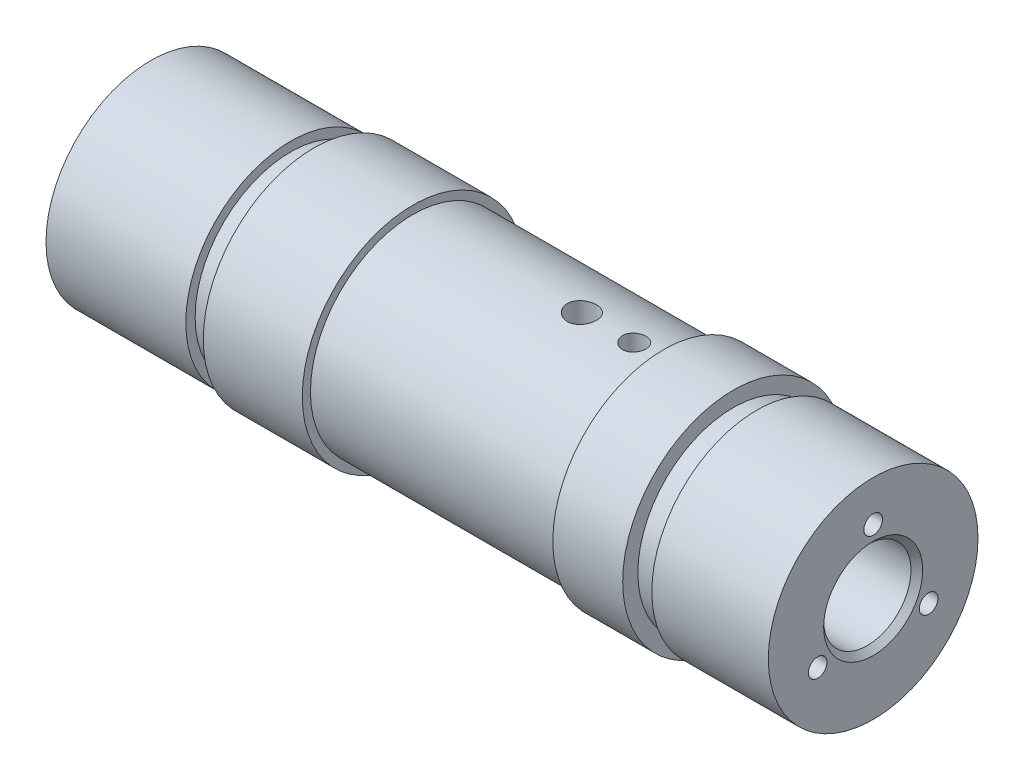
ISO-10303-21;
HEADER;
FILE_DESCRIPTION(('STEP AP214'),'2;1');
FILE_NAME('part.step','',(''),(''),'','','');
FILE_SCHEMA(('AUTOMOTIVE_DESIGN { 1 0 10303 214 1 1 1 1 }'));
ENDSEC;
DATA;
#1=APPLICATION_CONTEXT('core data for automotive mechanical design processes');
#2=APPLICATION_PROTOCOL_DEFINITION('international standard','automotive_design',2000,#1);
#3=PRODUCT_CONTEXT('',#1,'mechanical');
#4=PRODUCT('Part','Part','',(#3));
#5=PRODUCT_RELATED_PRODUCT_CATEGORY('part','',(#4));
#6=PRODUCT_DEFINITION_FORMATION('','',#4);
#7=PRODUCT_DEFINITION_CONTEXT('part definition',#1,'design');
#8=PRODUCT_DEFINITION('design','',#6,#7);
#9=PRODUCT_DEFINITION_SHAPE('','',#8);
#10=(LENGTH_UNIT() NAMED_UNIT(*) SI_UNIT(.MILLI.,.METRE.));
#11=(NAMED_UNIT(*) PLANE_ANGLE_UNIT() SI_UNIT($,.RADIAN.));
#12=(NAMED_UNIT(*) SI_UNIT($,.STERADIAN.) SOLID_ANGLE_UNIT());
#13=UNCERTAINTY_MEASURE_WITH_UNIT(LENGTH_MEASURE(1.E-05),#10,'distance_accuracy_value','');
#14=(GEOMETRIC_REPRESENTATION_CONTEXT(3) GLOBAL_UNCERTAINTY_ASSIGNED_CONTEXT((#13)) GLOBAL_UNIT_ASSIGNED_CONTEXT((#10,
#11,#12)) REPRESENTATION_CONTEXT('',''));
#15=CARTESIAN_POINT('',(0.,0.,0.));
#16=DIRECTION('',(0.,0.,1.));
#17=DIRECTION('',(1.,0.,0.));
#18=AXIS2_PLACEMENT_3D('',#15,#16,#17);
#19=CARTESIAN_POINT('',(0.,0.,0.));
#20=DIRECTION('',(-1.,0.,0.));
#21=DIRECTION('',(0.,0.,1.));
#22=AXIS2_PLACEMENT_3D('',#19,#20,#21);
#23=CYLINDRICAL_SURFACE('',#22,3.75);
#24=CARTESIAN_POINT('',(64.195,0.,0.));
#25=DIRECTION('',(-1.,0.,0.));
#26=DIRECTION('',(0.,0.,1.));
#27=AXIS2_PLACEMENT_3D('',#24,#25,#26);
#28=CIRCLE('',#27,3.75);
#29=CARTESIAN_POINT('',(64.195,0.,3.75));
#30=VERTEX_POINT('',#29);
#31=EDGE_CURVE('E246',#30,#30,#28,.T.);
#32=ORIENTED_EDGE('',*,*,#31,.F.);
#33=EDGE_LOOP('',(#32));
#34=FACE_BOUND('',#33,.T.);
#35=CARTESIAN_POINT('',(55.695,0.,0.));
#36=DIRECTION('',(-1.,0.,0.));
#37=DIRECTION('',(0.,0.,1.));
#38=AXIS2_PLACEMENT_3D('',#35,#36,#37);
#39=CIRCLE('',#38,3.75);
#40=CARTESIAN_POINT('',(55.695,0.,3.75));
#41=VERTEX_POINT('',#40);
#42=EDGE_CURVE('E40',#41,#41,#39,.F.);
#43=ORIENTED_EDGE('',*,*,#42,.F.);
#44=EDGE_LOOP('',(#43));
#45=FACE_BOUND('',#44,.T.);
#46=ADVANCED_FACE('F36',(#34,#45),#23,.F.);
#47=CARTESIAN_POINT('',(0.,0.,0.));
#48=DIRECTION('',(-1.,0.,0.));
#49=DIRECTION('',(0.,0.,1.));
#50=AXIS2_PLACEMENT_3D('',#47,#48,#49);
#51=CYLINDRICAL_SURFACE('',#50,9.5);
#52=CARTESIAN_POINT('',(46.695,0.,0.));
#53=DIRECTION('',(-1.,0.,0.));
#54=DIRECTION('',(0.,0.,1.));
#55=AXIS2_PLACEMENT_3D('',#52,#53,#54);
#56=CIRCLE('',#55,9.5);
#57=CARTESIAN_POINT('',(46.695,0.,9.5));
#58=VERTEX_POINT('',#57);
#59=EDGE_CURVE('E176',#58,#58,#56,.T.);
#60=ORIENTED_EDGE('',*,*,#59,.F.);
#61=EDGE_LOOP('',(#60));
#62=FACE_BOUND('',#61,.T.);
#63=CARTESIAN_POINT('',(52.695,0.,0.));
#64=DIRECTION('',(-1.,0.,0.));
#65=DIRECTION('',(0.,0.,1.));
#66=AXIS2_PLACEMENT_3D('',#63,#64,#65);
#67=CIRCLE('',#66,9.5);
#68=CARTESIAN_POINT('',(52.695,0.,9.5));
#69=VERTEX_POINT('',#68);
#70=EDGE_CURVE('E154',#69,#69,#67,.T.);
#71=ORIENTED_EDGE('',*,*,#70,.T.);
#72=EDGE_LOOP('',(#71));
#73=FACE_BOUND('',#72,.T.);
#74=ADVANCED_FACE('F197',(#62,#73),#51,.T.);
#75=CARTESIAN_POINT('',(46.695,9.5,0.));
#76=DIRECTION('',(1.,0.,0.));
#77=DIRECTION('',(0.,0.,-1.));
#78=AXIS2_PLACEMENT_3D('',#75,#76,#77);
#79=PLANE('',#78);
#80=CARTESIAN_POINT('',(46.695,0.,0.));
#81=DIRECTION('',(-1.,0.,0.));
#82=DIRECTION('',(0.,0.,1.));
#83=AXIS2_PLACEMENT_3D('',#80,#81,#82);
#84=CIRCLE('',#83,8.8);
#85=CARTESIAN_POINT('',(46.695,0.,8.8));
#86=VERTEX_POINT('',#85);
#87=EDGE_CURVE('E302',#86,#86,#84,.T.);
#88=ORIENTED_EDGE('',*,*,#87,.F.);
#89=EDGE_LOOP('',(#88));
#90=FACE_BOUND('',#89,.T.);
#91=ORIENTED_EDGE('',*,*,#59,.T.);
#92=EDGE_LOOP('',(#91));
#93=FACE_BOUND('',#92,.T.);
#94=ADVANCED_FACE('F138',(#90,#93),#79,.F.);
#95=CARTESIAN_POINT('',(0.,0.,0.));
#96=DIRECTION('',(-1.,0.,0.));
#97=DIRECTION('',(0.,0.,1.));
#98=AXIS2_PLACEMENT_3D('',#95,#96,#97);
#99=CYLINDRICAL_SURFACE('',#98,8.8);
#100=CARTESIAN_POINT('',(39.69,8.71076919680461,-1.24999999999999));
#101=CARTESIAN_POINT('',(39.7598319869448,8.710770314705,-1.24999708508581));
#102=CARTESIAN_POINT('',(39.8297055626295,8.71161801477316,-1.24412841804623));
#103=CARTESIAN_POINT('',(39.9675021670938,8.71491526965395,-1.22081331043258));
#104=CARTESIAN_POINT('',(40.0354231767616,8.71736642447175,-1.20335530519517));
#105=CARTESIAN_POINT('',(40.1672999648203,8.72358748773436,-1.15739174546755));
#106=CARTESIAN_POINT('',(40.2312586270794,8.72735642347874,-1.12889433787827));
#107=CARTESIAN_POINT('',(40.3534762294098,8.73578722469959,-1.06167954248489));
#108=CARTESIAN_POINT('',(40.411736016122,8.74044895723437,-1.02296367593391));
#109=CARTESIAN_POINT('',(40.5213310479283,8.75017759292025,-0.936113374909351));
#110=CARTESIAN_POINT('',(40.5726193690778,8.75524690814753,-0.887919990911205));
#111=CARTESIAN_POINT('',(40.6664093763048,8.76519794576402,-0.783609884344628));
#112=CARTESIAN_POINT('',(40.7089105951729,8.77007965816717,-0.72749274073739));
#113=CARTESIAN_POINT('',(40.7840915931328,8.77913052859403,-0.608629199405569));
#114=CARTESIAN_POINT('',(40.8167283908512,8.78329653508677,-0.54585535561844));
#115=CARTESIAN_POINT('',(40.870978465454,8.79041994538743,-0.415648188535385));
#116=CARTESIAN_POINT('',(40.8925922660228,8.79337740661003,-0.348215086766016));
#117=CARTESIAN_POINT('',(40.9240411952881,8.79773349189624,-0.211085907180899));
#118=CARTESIAN_POINT('',(40.9339547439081,8.7991424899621,-0.141408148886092));
#119=CARTESIAN_POINT('',(40.9419651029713,8.80027840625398,-0.00136481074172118));
#120=CARTESIAN_POINT('',(40.9400625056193,8.8000054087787,0.0690007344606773));
#121=CARTESIAN_POINT('',(40.9245567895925,8.79781641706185,0.207887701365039));
#122=CARTESIAN_POINT('',(40.9110380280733,8.79591226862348,0.276418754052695));
#123=CARTESIAN_POINT('',(40.8728159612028,8.79068814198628,0.410229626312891));
#124=CARTESIAN_POINT('',(40.8481123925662,8.78736813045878,0.47550936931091));
#125=CARTESIAN_POINT('',(40.7881344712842,8.77966491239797,0.601221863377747));
#126=CARTESIAN_POINT('',(40.7528242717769,8.77527811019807,0.661637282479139));
#127=CARTESIAN_POINT('',(40.6726615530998,8.76593086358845,0.775717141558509));
#128=CARTESIAN_POINT('',(40.6278084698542,8.76097038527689,0.829381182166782));
#129=CARTESIAN_POINT('',(40.5293623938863,8.75097799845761,0.928931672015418));
#130=CARTESIAN_POINT('',(40.4756957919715,8.7459458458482,0.97474533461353));
#131=CARTESIAN_POINT('',(40.361397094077,8.73642011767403,1.05672711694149));
#132=CARTESIAN_POINT('',(40.3007649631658,8.73192654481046,1.09289518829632));
#133=CARTESIAN_POINT('',(40.1741841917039,8.72398688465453,1.15456701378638));
#134=CARTESIAN_POINT('',(40.1082321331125,8.72054147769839,1.1800638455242));
#135=CARTESIAN_POINT('',(39.9729222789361,8.71510068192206,1.21959914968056));
#136=CARTESIAN_POINT('',(39.9035646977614,8.71310520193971,1.2336383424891));
#137=CARTESIAN_POINT('',(39.7640585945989,8.71080729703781,1.24976118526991));
#138=CARTESIAN_POINT('',(39.6939221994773,8.7104902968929,1.25194776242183));
#139=CARTESIAN_POINT('',(39.5542840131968,8.71154659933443,1.24457590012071));
#140=CARTESIAN_POINT('',(39.4847822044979,8.71291985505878,1.23501778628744));
#141=CARTESIAN_POINT('',(39.3487014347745,8.71718858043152,1.2045149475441));
#142=CARTESIAN_POINT('',(39.2821108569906,8.72007725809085,1.18362101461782));
#143=CARTESIAN_POINT('',(39.1533774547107,8.72704578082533,1.13109228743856));
#144=CARTESIAN_POINT('',(39.0912348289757,8.73112567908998,1.09945701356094));
#145=CARTESIAN_POINT('',(38.972698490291,8.74005147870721,1.02609437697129));
#146=CARTESIAN_POINT('',(38.9163465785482,8.74490238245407,0.984300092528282));
#147=CARTESIAN_POINT('',(38.8114199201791,8.75480834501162,0.891899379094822));
#148=CARTESIAN_POINT('',(38.7628455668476,8.75986341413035,0.841292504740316));
#149=CARTESIAN_POINT('',(38.6744859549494,8.76965342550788,0.732251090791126));
#150=CARTESIAN_POINT('',(38.6347687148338,8.77438570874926,0.673761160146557));
#151=CARTESIAN_POINT('',(38.5657235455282,8.78295617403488,0.550880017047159));
#152=CARTESIAN_POINT('',(38.5363953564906,8.78679437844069,0.486488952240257));
#153=CARTESIAN_POINT('',(38.4890707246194,8.79313252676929,0.353850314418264));
#154=CARTESIAN_POINT('',(38.4710363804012,8.79563694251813,0.285616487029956));
#155=CARTESIAN_POINT('',(38.4466884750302,8.79904404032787,0.147050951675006));
#156=CARTESIAN_POINT('',(38.4403742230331,8.79994681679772,0.0767193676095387));
#157=CARTESIAN_POINT('',(38.4396612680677,8.80004814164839,-0.0633840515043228));
#158=CARTESIAN_POINT('',(38.4451582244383,8.79926161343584,-0.13315536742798));
#159=CARTESIAN_POINT('',(38.467688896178,8.79610264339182,-0.270771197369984));
#160=CARTESIAN_POINT('',(38.4847225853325,8.79373020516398,-0.338615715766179));
#161=CARTESIAN_POINT('',(38.5298075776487,8.78766472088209,-0.470428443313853));
#162=CARTESIAN_POINT('',(38.5578523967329,8.78397245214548,-0.534398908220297));
#163=CARTESIAN_POINT('',(38.6241525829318,8.77567395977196,-0.656742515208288));
#164=CARTESIAN_POINT('',(38.6624082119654,8.77106771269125,-0.715115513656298));
#165=CARTESIAN_POINT('',(38.74842445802,8.76140558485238,-0.825137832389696));
#166=CARTESIAN_POINT('',(38.7962623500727,8.75634624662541,-0.876726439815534));
#167=CARTESIAN_POINT('',(38.8999228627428,8.74637446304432,-0.971182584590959));
#168=CARTESIAN_POINT('',(38.9557473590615,8.74146205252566,-1.01404806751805));
#169=CARTESIAN_POINT('',(39.0741230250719,8.73231401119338,-1.09003134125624));
#170=CARTESIAN_POINT('',(39.1367064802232,8.72808189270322,-1.12309924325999));
#171=CARTESIAN_POINT('',(39.2665676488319,8.72081473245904,-1.17820616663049));
#172=CARTESIAN_POINT('',(39.3338403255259,8.7177784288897,-1.20025681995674));
#173=CARTESIAN_POINT('',(39.4495261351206,8.71396034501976,-1.22760548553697));
#174=CARTESIAN_POINT('',(39.4972192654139,8.7127698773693,-1.23599084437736));
#175=CARTESIAN_POINT('',(39.5932682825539,8.71117392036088,-1.24718908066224));
#176=CARTESIAN_POINT('',(39.6416241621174,8.71076842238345,-1.25000201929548));
#177=CARTESIAN_POINT('',(39.69,8.71076919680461,-1.24999999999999));
#178=B_SPLINE_CURVE_WITH_KNOTS('',3,(#100,#101,#102,#103,#104,#105,#106,#107,#108,#109,#110,
#111,#112,#113,#114,#115,#116,#117,#118,#119,#120,#121,#122,#123,#124,#125,#126,#127,#128,#129,
#130,#131,#132,#133,#134,#135,#136,#137,#138,#139,#140,#141,#142,#143,#144,#145,#146,#147,#148,
#149,#150,#151,#152,#153,#154,#155,#156,#157,#158,#159,#160,#161,#162,#163,#164,#165,#166,#167,
#168,#169,#170,#171,#172,#173,#174,#175,#176,#177),.UNSPECIFIED.,.T.,.F.,(4,2,2,2,2,2,2,2,2,2,2,
2,2,2,2,2,2,2,2,2,2,2,2,2,2,2,2,2,2,2,2,2,2,2,2,2,2,2,4),(0.,0.209319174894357,
0.418847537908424,0.628221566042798,0.837564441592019,1.04825312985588,1.25895301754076,
1.47055815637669,1.68215324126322,1.89232192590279,2.1024800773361,2.31112482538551,
2.51977448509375,2.72913740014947,2.93851269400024,3.14973500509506,3.36095837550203,
3.57231855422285,3.78366544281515,3.99317403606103,4.20267682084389,4.41124855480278,
4.61982960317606,4.8298237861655,5.03982858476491,5.25139446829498,5.46295505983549,
5.67380180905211,5.88463612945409,6.09361559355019,6.3025945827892,6.51145069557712,
6.72031216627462,6.93093119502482,7.14159977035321,7.35332331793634,7.56482285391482,
7.70982949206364,7.85483453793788),.UNSPECIFIED.);
#179=CARTESIAN_POINT('',(39.69,8.71076919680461,-1.24999999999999));
#180=VERTEX_POINT('',#179);
#181=EDGE_CURVE('E102',#180,#180,#178,.T.);
#182=ORIENTED_EDGE('',*,*,#181,.T.);
#183=EDGE_LOOP('',(#182));
#184=FACE_BOUND('',#183,.T.);
#185=CARTESIAN_POINT('',(44.19,-8.74299719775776,0.999999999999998));
#186=CARTESIAN_POINT('',(44.245975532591,-8.74299793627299,0.999997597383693));
#187=CARTESIAN_POINT('',(44.3019870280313,-8.74354055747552,0.995284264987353));
#188=CARTESIAN_POINT('',(44.4124540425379,-8.74565184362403,0.976554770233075));
#189=CARTESIAN_POINT('',(44.4669078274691,-8.74722160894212,0.96252863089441));
#190=CARTESIAN_POINT('',(44.5726438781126,-8.75120713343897,0.925589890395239));
#191=CARTESIAN_POINT('',(44.6239281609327,-8.75362234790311,0.902683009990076));
#192=CARTESIAN_POINT('',(44.721914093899,-8.75902597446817,0.848644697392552));
#193=CARTESIAN_POINT('',(44.7686165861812,-8.76201428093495,0.817514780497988));
#194=CARTESIAN_POINT('',(44.8563407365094,-8.76824295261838,0.747758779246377));
#195=CARTESIAN_POINT('',(44.8973380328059,-8.77148431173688,0.709102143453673));
#196=CARTESIAN_POINT('',(44.9722778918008,-8.77784489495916,0.625455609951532));
#197=CARTESIAN_POINT('',(45.0062201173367,-8.78096411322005,0.580465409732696));
#198=CARTESIAN_POINT('',(45.0661723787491,-8.78673899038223,0.485277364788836));
#199=CARTESIAN_POINT('',(45.0921605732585,-8.78939336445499,0.435065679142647));
#200=CARTESIAN_POINT('',(45.1353272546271,-8.79392859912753,0.33095568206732));
#201=CARTESIAN_POINT('',(45.152506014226,-8.79580948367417,0.27705748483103));
#202=CARTESIAN_POINT('',(45.177493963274,-8.79857882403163,0.167352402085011));
#203=CARTESIAN_POINT('',(45.1853434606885,-8.79947154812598,0.111554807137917));
#204=CARTESIAN_POINT('',(45.1915748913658,-8.80017853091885,-0.000572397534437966));
#205=CARTESIAN_POINT('',(45.189957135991,-8.79999282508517,-0.0569019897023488));
#206=CARTESIAN_POINT('',(45.1773324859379,-8.79856734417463,-0.168220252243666));
#207=CARTESIAN_POINT('',(45.1663689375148,-8.79733243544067,-0.223213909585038));
#208=CARTESIAN_POINT('',(45.1354315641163,-8.79395282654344,-0.330575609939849));
#209=CARTESIAN_POINT('',(45.1154575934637,-8.7918081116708,-0.382943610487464));
#210=CARTESIAN_POINT('',(45.0670195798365,-8.7868415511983,-0.483702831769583));
#211=CARTESIAN_POINT('',(45.0385365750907,-8.78401819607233,-0.53208485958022));
#212=CARTESIAN_POINT('',(44.9739028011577,-8.77801068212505,-0.623398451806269));
#213=CARTESIAN_POINT('',(44.9377517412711,-8.77482650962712,-0.666329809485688));
#214=CARTESIAN_POINT('',(44.8585647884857,-8.76843295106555,-0.745777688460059));
#215=CARTESIAN_POINT('',(44.8154911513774,-8.76522352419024,-0.782256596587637));
#216=CARTESIAN_POINT('',(44.7238119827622,-8.75915902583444,-0.847472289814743));
#217=CARTESIAN_POINT('',(44.6752064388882,-8.75630395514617,-0.876209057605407));
#218=CARTESIAN_POINT('',(44.5738118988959,-8.7512713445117,-0.925125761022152));
#219=CARTESIAN_POINT('',(44.5210215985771,-8.74909401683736,-0.945303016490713));
#220=CARTESIAN_POINT('',(44.4127719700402,-8.74566769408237,-0.976496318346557));
#221=CARTESIAN_POINT('',(44.3573127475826,-8.74441866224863,-0.987512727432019));
#222=CARTESIAN_POINT('',(44.2456307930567,-8.74299691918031,-1.00002249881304));
#223=CARTESIAN_POINT('',(44.1894140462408,-8.74281824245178,-1.00156864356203));
#224=CARTESIAN_POINT('',(44.0775223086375,-8.74354168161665,-0.995232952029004));
#225=CARTESIAN_POINT('',(44.0218473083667,-8.74444377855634,-0.987351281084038));
#226=CARTESIAN_POINT('',(43.9127755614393,-8.74722168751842,-0.962427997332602));
#227=CARTESIAN_POINT('',(43.8593729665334,-8.74909481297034,-0.94541165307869));
#228=CARTESIAN_POINT('',(43.756179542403,-8.75360154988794,-0.902727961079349));
#229=CARTESIAN_POINT('',(43.7063888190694,-8.75623518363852,-0.877060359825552));
#230=CARTESIAN_POINT('',(43.6115928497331,-8.76198056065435,-0.817671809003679));
#231=CARTESIAN_POINT('',(43.566609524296,-8.76509434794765,-0.783916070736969));
#232=CARTESIAN_POINT('',(43.482928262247,-8.77144264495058,-0.709358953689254));
#233=CARTESIAN_POINT('',(43.4442305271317,-8.77467715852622,-0.668557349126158));
#234=CARTESIAN_POINT('',(43.3740351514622,-8.78092063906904,-0.580836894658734));
#235=CARTESIAN_POINT('',(43.3425720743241,-8.78392847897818,-0.533890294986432));
#236=CARTESIAN_POINT('',(43.287977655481,-8.78936308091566,-0.435348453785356));
#237=CARTESIAN_POINT('',(43.2648461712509,-8.79178985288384,-0.383753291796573));
#238=CARTESIAN_POINT('',(43.2276293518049,-8.79578384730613,-0.277496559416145));
#239=CARTESIAN_POINT('',(43.2135236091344,-8.79735300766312,-0.22284221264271));
#240=CARTESIAN_POINT('',(43.1946921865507,-8.79946298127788,-0.111921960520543));
#241=CARTESIAN_POINT('',(43.1899661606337,-8.80000383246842,-0.0556561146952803));
#242=CARTESIAN_POINT('',(43.1900340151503,-8.79999614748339,0.0565515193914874));
#243=CARTESIAN_POINT('',(43.1947744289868,-8.79945372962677,0.112493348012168));
#244=CARTESIAN_POINT('',(43.2135279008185,-8.7973525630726,0.222780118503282));
#245=CARTESIAN_POINT('',(43.2275409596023,-8.79579381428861,0.277125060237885));
#246=CARTESIAN_POINT('',(43.2644260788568,-8.79183446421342,0.382671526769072));
#247=CARTESIAN_POINT('',(43.2872960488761,-8.78943406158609,0.433873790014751));
#248=CARTESIAN_POINT('',(43.3412402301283,-8.78405805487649,0.531721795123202));
#249=CARTESIAN_POINT('',(43.3723144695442,-8.78108244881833,0.578367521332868));
#250=CARTESIAN_POINT('',(43.4419843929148,-8.77486868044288,0.666052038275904));
#251=CARTESIAN_POINT('',(43.4806199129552,-8.77162918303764,0.707059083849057));
#252=CARTESIAN_POINT('',(43.5642343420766,-8.76526376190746,0.782029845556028));
#253=CARTESIAN_POINT('',(43.6092147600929,-8.762137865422,0.815991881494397));
#254=CARTESIAN_POINT('',(43.704404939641,-8.75634286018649,0.875998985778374));
#255=CARTESIAN_POINT('',(43.7546310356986,-8.75367525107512,0.902018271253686));
#256=CARTESIAN_POINT('',(43.8587399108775,-8.74911652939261,0.94521747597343));
#257=CARTESIAN_POINT('',(43.9126185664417,-8.74722455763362,0.962407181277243));
#258=CARTESIAN_POINT('',(44.0039909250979,-8.74489931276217,0.983260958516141));
#259=CARTESIAN_POINT('',(44.0409043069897,-8.74418948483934,0.989529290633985));
#260=CARTESIAN_POINT('',(44.1152064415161,-8.74323818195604,0.997899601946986));
#261=CARTESIAN_POINT('',(44.152595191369,-8.74299670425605,1.00000160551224));
#262=CARTESIAN_POINT('',(44.19,-8.74299719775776,0.999999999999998));
#263=B_SPLINE_CURVE_WITH_KNOTS('',3,(#185,#186,#187,#188,#189,#190,#191,#192,#193,#194,#195,
#196,#197,#198,#199,#200,#201,#202,#203,#204,#205,#206,#207,#208,#209,#210,#211,#212,#213,#214,
#215,#216,#217,#218,#219,#220,#221,#222,#223,#224,#225,#226,#227,#228,#229,#230,#231,#232,#233,
#234,#235,#236,#237,#238,#239,#240,#241,#242,#243,#244,#245,#246,#247,#248,#249,#250,#251,#252,
#253,#254,#255,#256,#257,#258,#259,#260,#261,#262),.UNSPECIFIED.,.T.,.F.,(4,2,2,2,2,2,2,2,2,2,2,
2,2,2,2,2,2,2,2,2,2,2,2,2,2,2,2,2,2,2,2,2,2,2,2,2,2,2,4),(0.,0.167789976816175,
0.335760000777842,0.50362200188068,0.671453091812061,0.839980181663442,1.00851532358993,
1.17750918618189,1.34649781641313,1.51475362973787,1.68300390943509,1.85047805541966,
2.01795490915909,2.18580779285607,2.35366704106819,2.5224746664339,2.69128266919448,
2.86014349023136,3.02899762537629,3.19690979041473,3.36481901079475,3.53226613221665,
3.69971816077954,3.86790378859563,4.03609480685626,4.20507339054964,4.37404908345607,
4.54264135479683,4.71122740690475,4.87886397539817,5.04650055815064,5.214097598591,
5.38169521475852,5.55020080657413,5.71874653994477,5.88783370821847,6.05673306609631,
6.16885685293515,6.28097998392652),.UNSPECIFIED.);
#264=CARTESIAN_POINT('',(44.19,-8.74299719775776,0.999999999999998));
#265=VERTEX_POINT('',#264);
#266=EDGE_CURVE('E149',#265,#265,#263,.T.);
#267=ORIENTED_EDGE('',*,*,#266,.T.);
#268=EDGE_LOOP('',(#267));
#269=FACE_BOUND('',#268,.T.);
#270=CARTESIAN_POINT('',(44.19,8.74299719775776,0.999999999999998));
#271=CARTESIAN_POINT('',(44.134024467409,8.74299793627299,0.999997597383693));
#272=CARTESIAN_POINT('',(44.0780129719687,8.74354055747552,0.995284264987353));
#273=CARTESIAN_POINT('',(43.9675459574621,8.74565184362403,0.976554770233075));
#274=CARTESIAN_POINT('',(43.9130921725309,8.74722160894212,0.962528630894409));
#275=CARTESIAN_POINT('',(43.8073561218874,8.75120713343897,0.925589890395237));
#276=CARTESIAN_POINT('',(43.7560718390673,8.75362234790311,0.902683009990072));
#277=CARTESIAN_POINT('',(43.6580859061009,8.75902597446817,0.848644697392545));
#278=CARTESIAN_POINT('',(43.6113834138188,8.76201428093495,0.817514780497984));
#279=CARTESIAN_POINT('',(43.5236592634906,8.76824295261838,0.747758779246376));
#280=CARTESIAN_POINT('',(43.4826619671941,8.77148431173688,0.709102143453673));
#281=CARTESIAN_POINT('',(43.4077221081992,8.77784489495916,0.625455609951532));
#282=CARTESIAN_POINT('',(43.3737798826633,8.78096411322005,0.580465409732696));
#283=CARTESIAN_POINT('',(43.3138276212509,8.78673899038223,0.485277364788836));
#284=CARTESIAN_POINT('',(43.2878394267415,8.78939336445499,0.435065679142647));
#285=CARTESIAN_POINT('',(43.244672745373,8.79392859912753,0.33095568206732));
#286=CARTESIAN_POINT('',(43.227493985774,8.79580948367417,0.27705748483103));
#287=CARTESIAN_POINT('',(43.202506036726,8.79857882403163,0.167352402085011));
#288=CARTESIAN_POINT('',(43.1946565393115,8.79947154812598,0.111554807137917));
#289=CARTESIAN_POINT('',(43.1884251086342,8.80017853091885,-0.000572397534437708));
#290=CARTESIAN_POINT('',(43.190042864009,8.79999282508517,-0.0569019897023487));
#291=CARTESIAN_POINT('',(43.2026675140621,8.79856734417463,-0.168220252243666));
#292=CARTESIAN_POINT('',(43.2136310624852,8.79733243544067,-0.223213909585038));
#293=CARTESIAN_POINT('',(43.2445684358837,8.79395282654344,-0.330575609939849));
#294=CARTESIAN_POINT('',(43.2645424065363,8.7918081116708,-0.382943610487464));
#295=CARTESIAN_POINT('',(43.3129804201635,8.7868415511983,-0.483702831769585));
#296=CARTESIAN_POINT('',(43.3414634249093,8.78401819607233,-0.532084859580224));
#297=CARTESIAN_POINT('',(43.4060971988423,8.77801068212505,-0.623398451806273));
#298=CARTESIAN_POINT('',(43.4422482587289,8.77482650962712,-0.66632980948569));
#299=CARTESIAN_POINT('',(43.5214352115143,8.76843295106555,-0.745777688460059));
#300=CARTESIAN_POINT('',(43.5645088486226,8.76522352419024,-0.782256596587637));
#301=CARTESIAN_POINT('',(43.6561880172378,8.75915902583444,-0.847472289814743));
#302=CARTESIAN_POINT('',(43.7047935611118,8.75630395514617,-0.876209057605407));
#303=CARTESIAN_POINT('',(43.8061881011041,8.7512713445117,-0.925125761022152));
#304=CARTESIAN_POINT('',(43.8589784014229,8.74909401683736,-0.945303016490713));
#305=CARTESIAN_POINT('',(43.9672280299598,8.74566769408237,-0.976496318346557));
#306=CARTESIAN_POINT('',(44.0226872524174,8.74441866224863,-0.987512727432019));
#307=CARTESIAN_POINT('',(44.1343692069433,8.74299691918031,-1.00002249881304));
#308=CARTESIAN_POINT('',(44.1905859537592,8.74281824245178,-1.00156864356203));
#309=CARTESIAN_POINT('',(44.3024776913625,8.74354168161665,-0.995232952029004));
#310=CARTESIAN_POINT('',(44.3581526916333,8.74444377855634,-0.987351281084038));
#311=CARTESIAN_POINT('',(44.4672244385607,8.74722168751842,-0.962427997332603));
#312=CARTESIAN_POINT('',(44.5206270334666,8.74909481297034,-0.945411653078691));
#313=CARTESIAN_POINT('',(44.623820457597,8.75360154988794,-0.902727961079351));
#314=CARTESIAN_POINT('',(44.6736111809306,8.75623518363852,-0.877060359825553));
#315=CARTESIAN_POINT('',(44.7684071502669,8.76198056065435,-0.817671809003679));
#316=CARTESIAN_POINT('',(44.813390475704,8.76509434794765,-0.783916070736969));
#317=CARTESIAN_POINT('',(44.897071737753,8.77144264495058,-0.709358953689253));
#318=CARTESIAN_POINT('',(44.9357694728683,8.77467715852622,-0.668557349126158));
#319=CARTESIAN_POINT('',(45.0059648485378,8.78092063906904,-0.580836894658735));
#320=CARTESIAN_POINT('',(45.0374279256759,8.78392847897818,-0.533890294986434));
#321=CARTESIAN_POINT('',(45.092022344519,8.78936308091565,-0.435348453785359));
#322=CARTESIAN_POINT('',(45.1151538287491,8.79178985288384,-0.383753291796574));
#323=CARTESIAN_POINT('',(45.1523706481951,8.79578384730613,-0.277496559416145));
#324=CARTESIAN_POINT('',(45.1664763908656,8.79735300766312,-0.22284221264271));
#325=CARTESIAN_POINT('',(45.1853078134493,8.79946298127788,-0.111921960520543));
#326=CARTESIAN_POINT('',(45.1900338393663,8.80000383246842,-0.0556561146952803));
#327=CARTESIAN_POINT('',(45.1899659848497,8.79999614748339,0.0565515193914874));
#328=CARTESIAN_POINT('',(45.1852255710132,8.79945372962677,0.112493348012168));
#329=CARTESIAN_POINT('',(45.1664720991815,8.7973525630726,0.222780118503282));
#330=CARTESIAN_POINT('',(45.1524590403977,8.79579381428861,0.277125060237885));
#331=CARTESIAN_POINT('',(45.1155739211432,8.79183446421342,0.382671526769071));
#332=CARTESIAN_POINT('',(45.0927039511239,8.78943406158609,0.433873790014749));
#333=CARTESIAN_POINT('',(45.0387597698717,8.78405805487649,0.5317217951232));
#334=CARTESIAN_POINT('',(45.0076855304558,8.78108244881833,0.578367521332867));
#335=CARTESIAN_POINT('',(44.9380156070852,8.77486868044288,0.666052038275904));
#336=CARTESIAN_POINT('',(44.8993800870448,8.77162918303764,0.707059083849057));
#337=CARTESIAN_POINT('',(44.8157656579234,8.76526376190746,0.782029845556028));
#338=CARTESIAN_POINT('',(44.7707852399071,8.762137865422,0.815991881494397));
#339=CARTESIAN_POINT('',(44.675595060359,8.75634286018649,0.875998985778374));
#340=CARTESIAN_POINT('',(44.6253689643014,8.75367525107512,0.902018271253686));
#341=CARTESIAN_POINT('',(44.5212600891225,8.74911652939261,0.94521747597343));
#342=CARTESIAN_POINT('',(44.4673814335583,8.74722455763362,0.962407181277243));
#343=CARTESIAN_POINT('',(44.3760090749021,8.74489931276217,0.983260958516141));
#344=CARTESIAN_POINT('',(44.3390956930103,8.74418948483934,0.989529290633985));
#345=CARTESIAN_POINT('',(44.2647935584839,8.74323818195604,0.997899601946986));
#346=CARTESIAN_POINT('',(44.227404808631,8.74299670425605,1.00000160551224));
#347=CARTESIAN_POINT('',(44.19,8.74299719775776,0.999999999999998));
#348=B_SPLINE_CURVE_WITH_KNOTS('',3,(#270,#271,#272,#273,#274,#275,#276,#277,#278,#279,#280,
#281,#282,#283,#284,#285,#286,#287,#288,#289,#290,#291,#292,#293,#294,#295,#296,#297,#298,#299,
#300,#301,#302,#303,#304,#305,#306,#307,#308,#309,#310,#311,#312,#313,#314,#315,#316,#317,#318,
#319,#320,#321,#322,#323,#324,#325,#326,#327,#328,#329,#330,#331,#332,#333,#334,#335,#336,#337,
#338,#339,#340,#341,#342,#343,#344,#345,#346,#347),.UNSPECIFIED.,.T.,.F.,(4,2,2,2,2,2,2,2,2,2,2,
2,2,2,2,2,2,2,2,2,2,2,2,2,2,2,2,2,2,2,2,2,2,2,2,2,2,2,4),(0.,0.167789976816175,
0.335760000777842,0.503622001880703,0.671453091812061,0.839980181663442,1.00851532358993,
1.17750918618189,1.34649781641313,1.51475362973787,1.68300390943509,1.85047805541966,
2.01795490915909,2.18580779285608,2.35366704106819,2.5224746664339,2.69128266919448,
2.86014349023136,3.02899762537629,3.19690979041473,3.36481901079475,3.53226613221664,
3.69971816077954,3.86790378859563,4.03609480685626,4.20507339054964,4.37404908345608,
4.54264135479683,4.71122740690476,4.87886397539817,5.04650055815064,5.21409759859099,
5.38169521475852,5.55020080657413,5.71874653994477,5.88783370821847,6.05673306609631,
6.16885685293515,6.28097998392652),.UNSPECIFIED.);
#349=CARTESIAN_POINT('',(44.19,8.74299719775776,0.999999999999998));
#350=VERTEX_POINT('',#349);
#351=EDGE_CURVE('E144',#350,#350,#348,.T.);
#352=ORIENTED_EDGE('',*,*,#351,.T.);
#353=EDGE_LOOP('',(#352));
#354=FACE_BOUND('',#353,.T.);
#355=CARTESIAN_POINT('',(25.19,0.,0.));
#356=DIRECTION('',(-1.,0.,0.));
#357=DIRECTION('',(0.,0.,1.));
#358=AXIS2_PLACEMENT_3D('',#355,#356,#357);
#359=CIRCLE('',#358,8.8);
#360=CARTESIAN_POINT('',(25.19,0.,8.8));
#361=VERTEX_POINT('',#360);
#362=EDGE_CURVE('E300',#361,#361,#359,.T.);
#363=ORIENTED_EDGE('',*,*,#362,.F.);
#364=EDGE_LOOP('',(#363));
#365=FACE_BOUND('',#364,.T.);
#366=ORIENTED_EDGE('',*,*,#87,.T.);
#367=EDGE_LOOP('',(#366));
#368=FACE_BOUND('',#367,.T.);
#369=ADVANCED_FACE('F132',(#184,#269,#354,#365,#368),#99,.T.);
#370=CARTESIAN_POINT('',(25.19,9.5,0.));
#371=DIRECTION('',(-1.,0.,0.));
#372=DIRECTION('',(0.,0.,1.));
#373=AXIS2_PLACEMENT_3D('',#370,#371,#372);
#374=PLANE('',#373);
#375=CARTESIAN_POINT('',(25.19,0.,0.));
#376=DIRECTION('',(-1.,0.,0.));
#377=DIRECTION('',(0.,0.,1.));
#378=AXIS2_PLACEMENT_3D('',#375,#376,#377);
#379=CIRCLE('',#378,9.5);
#380=CARTESIAN_POINT('',(25.19,0.,9.5));
#381=VERTEX_POINT('',#380);
#382=EDGE_CURVE('E297',#381,#381,#379,.T.);
#383=ORIENTED_EDGE('',*,*,#382,.F.);
#384=EDGE_LOOP('',(#383));
#385=FACE_BOUND('',#384,.T.);
#386=ORIENTED_EDGE('',*,*,#362,.T.);
#387=EDGE_LOOP('',(#386));
#388=FACE_BOUND('',#387,.T.);
#389=ADVANCED_FACE('F137',(#385,#388),#374,.F.);
#390=CARTESIAN_POINT('',(0.,0.,0.));
#391=DIRECTION('',(-1.,0.,0.));
#392=DIRECTION('',(0.,0.,1.));
#393=AXIS2_PLACEMENT_3D('',#390,#391,#392);
#394=CYLINDRICAL_SURFACE('',#393,9.5);
#395=CARTESIAN_POINT('',(16.69,0.,0.));
#396=DIRECTION('',(-1.,0.,0.));
#397=DIRECTION('',(0.,0.,1.));
#398=AXIS2_PLACEMENT_3D('',#395,#396,#397);
#399=CIRCLE('',#398,9.5);
#400=CARTESIAN_POINT('',(16.69,0.,9.5));
#401=VERTEX_POINT('',#400);
#402=EDGE_CURVE('E294',#401,#401,#399,.T.);
#403=ORIENTED_EDGE('',*,*,#402,.F.);
#404=EDGE_LOOP('',(#403));
#405=FACE_BOUND('',#404,.T.);
#406=ORIENTED_EDGE('',*,*,#382,.T.);
#407=EDGE_LOOP('',(#406));
#408=FACE_BOUND('',#407,.T.);
#409=ADVANCED_FACE('F337',(#405,#408),#394,.T.);
#410=CARTESIAN_POINT('',(16.69,9.5,0.));
#411=DIRECTION('',(1.,0.,0.));
#412=DIRECTION('',(0.,0.,-1.));
#413=AXIS2_PLACEMENT_3D('',#410,#411,#412);
#414=PLANE('',#413);
#415=CARTESIAN_POINT('',(16.69,0.,0.));
#416=DIRECTION('',(-1.,0.,0.));
#417=DIRECTION('',(0.,0.,1.));
#418=AXIS2_PLACEMENT_3D('',#415,#416,#417);
#419=CIRCLE('',#418,8.2);
#420=CARTESIAN_POINT('',(16.69,0.,8.2));
#421=VERTEX_POINT('',#420);
#422=EDGE_CURVE('E291',#421,#421,#419,.T.);
#423=ORIENTED_EDGE('',*,*,#422,.F.);
#424=EDGE_LOOP('',(#423));
#425=FACE_BOUND('',#424,.T.);
#426=ORIENTED_EDGE('',*,*,#402,.T.);
#427=EDGE_LOOP('',(#426));
#428=FACE_BOUND('',#427,.T.);
#429=ADVANCED_FACE('F342',(#425,#428),#414,.F.);
#430=CARTESIAN_POINT('',(0.,0.,0.));
#431=DIRECTION('',(-1.,0.,0.));
#432=DIRECTION('',(0.,0.,1.));
#433=AXIS2_PLACEMENT_3D('',#430,#431,#432);
#434=CYLINDRICAL_SURFACE('',#433,8.2);
#435=CARTESIAN_POINT('',(14.69,0.,0.));
#436=DIRECTION('',(-1.,0.,0.));
#437=DIRECTION('',(0.,0.,1.));
#438=AXIS2_PLACEMENT_3D('',#435,#436,#437);
#439=CIRCLE('',#438,8.2);
#440=CARTESIAN_POINT('',(14.69,0.,8.2));
#441=VERTEX_POINT('',#440);
#442=EDGE_CURVE('E288',#441,#441,#439,.T.);
#443=ORIENTED_EDGE('',*,*,#442,.F.);
#444=EDGE_LOOP('',(#443));
#445=FACE_BOUND('',#444,.T.);
#446=ORIENTED_EDGE('',*,*,#422,.T.);
#447=EDGE_LOOP('',(#446));
#448=FACE_BOUND('',#447,.T.);
#449=ADVANCED_FACE('F349',(#445,#448),#434,.T.);
#450=CARTESIAN_POINT('',(14.69,8.2,0.));
#451=DIRECTION('',(-1.,0.,0.));
#452=DIRECTION('',(0.,0.,1.));
#453=AXIS2_PLACEMENT_3D('',#450,#451,#452);
#454=PLANE('',#453);
#455=CARTESIAN_POINT('',(14.69,0.,0.));
#456=DIRECTION('',(-1.,0.,0.));
#457=DIRECTION('',(0.,0.,1.));
#458=AXIS2_PLACEMENT_3D('',#455,#456,#457);
#459=CIRCLE('',#458,9.);
#460=CARTESIAN_POINT('',(14.69,0.,9.));
#461=VERTEX_POINT('',#460);
#462=EDGE_CURVE('E285',#461,#461,#459,.T.);
#463=ORIENTED_EDGE('',*,*,#462,.F.);
#464=EDGE_LOOP('',(#463));
#465=FACE_BOUND('',#464,.T.);
#466=ORIENTED_EDGE('',*,*,#442,.T.);
#467=EDGE_LOOP('',(#466));
#468=FACE_BOUND('',#467,.T.);
#469=ADVANCED_FACE('F356',(#465,#468),#454,.F.);
#470=CARTESIAN_POINT('',(0.,0.,0.));
#471=DIRECTION('',(-1.,0.,0.));
#472=DIRECTION('',(0.,0.,1.));
#473=AXIS2_PLACEMENT_3D('',#470,#471,#472);
#474=CYLINDRICAL_SURFACE('',#473,9.);
#475=CARTESIAN_POINT('',(2.69,0.,0.));
#476=DIRECTION('',(-1.,0.,0.));
#477=DIRECTION('',(0.,0.,1.));
#478=AXIS2_PLACEMENT_3D('',#475,#476,#477);
#479=CIRCLE('',#478,9.);
#480=CARTESIAN_POINT('',(2.69,0.,9.));
#481=VERTEX_POINT('',#480);
#482=EDGE_CURVE('E282',#481,#481,#479,.T.);
#483=ORIENTED_EDGE('',*,*,#482,.F.);
#484=EDGE_LOOP('',(#483));
#485=FACE_BOUND('',#484,.T.);
#486=ORIENTED_EDGE('',*,*,#462,.T.);
#487=EDGE_LOOP('',(#486));
#488=FACE_BOUND('',#487,.T.);
#489=ADVANCED_FACE('F360',(#485,#488),#474,.T.);
#490=CARTESIAN_POINT('',(2.69,9.,0.));
#491=DIRECTION('',(1.,0.,0.));
#492=DIRECTION('',(0.,0.,-1.));
#493=AXIS2_PLACEMENT_3D('',#490,#491,#492);
#494=PLANE('',#493);
#495=CARTESIAN_POINT('',(2.69,0.,6.));
#496=DIRECTION('',(-1.,0.,0.));
#497=DIRECTION('',(0.,0.,1.));
#498=AXIS2_PLACEMENT_3D('',#495,#496,#497);
#499=CIRCLE('',#498,0.799999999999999);
#500=CARTESIAN_POINT('',(2.69,0.,6.8));
#501=VERTEX_POINT('',#500);
#502=EDGE_CURVE('E78',#501,#501,#499,.T.);
#503=ORIENTED_EDGE('',*,*,#502,.F.);
#504=EDGE_LOOP('',(#503));
#505=FACE_BOUND('',#504,.T.);
#506=CARTESIAN_POINT('',(2.69,0.,-6.));
#507=DIRECTION('',(-1.,0.,0.));
#508=DIRECTION('',(0.,0.,1.));
#509=AXIS2_PLACEMENT_3D('',#506,#507,#508);
#510=CIRCLE('',#509,0.799999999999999);
#511=CARTESIAN_POINT('',(2.69,0.,-5.2));
#512=VERTEX_POINT('',#511);
#513=EDGE_CURVE('E77',#512,#512,#510,.T.);
#514=ORIENTED_EDGE('',*,*,#513,.F.);
#515=EDGE_LOOP('',(#514));
#516=FACE_BOUND('',#515,.T.);
#517=CARTESIAN_POINT('',(2.69,6.25,0.));
#518=DIRECTION('',(-1.,0.,0.));
#519=DIRECTION('',(0.,0.,1.));
#520=AXIS2_PLACEMENT_3D('',#517,#518,#519);
#521=CIRCLE('',#520,0.79999999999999);
#522=CARTESIAN_POINT('',(2.69,6.25,0.79999999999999));
#523=VERTEX_POINT('',#522);
#524=EDGE_CURVE('E101',#523,#523,#521,.T.);
#525=ORIENTED_EDGE('',*,*,#524,.F.);
#526=EDGE_LOOP('',(#525));
#527=FACE_BOUND('',#526,.T.);
#528=CARTESIAN_POINT('',(2.69,-6.25,0.));
#529=DIRECTION('',(-1.,0.,0.));
#530=DIRECTION('',(0.,0.,1.));
#531=AXIS2_PLACEMENT_3D('',#528,#529,#530);
#532=CIRCLE('',#531,0.79999999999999);
#533=CARTESIAN_POINT('',(2.69,-6.25,0.79999999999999));
#534=VERTEX_POINT('',#533);
#535=EDGE_CURVE('E543',#534,#534,#532,.T.);
#536=ORIENTED_EDGE('',*,*,#535,.F.);
#537=EDGE_LOOP('',(#536));
#538=FACE_BOUND('',#537,.T.);
#539=CARTESIAN_POINT('',(2.69,0.,0.));
#540=DIRECTION('',(-1.,0.,0.));
#541=DIRECTION('',(0.,0.,1.));
#542=AXIS2_PLACEMENT_3D('',#539,#540,#541);
#543=CIRCLE('',#542,3.65);
#544=CARTESIAN_POINT('',(2.69,0.,3.65));
#545=VERTEX_POINT('',#544);
#546=EDGE_CURVE('E279',#545,#545,#543,.T.);
#547=ORIENTED_EDGE('',*,*,#546,.F.);
#548=EDGE_LOOP('',(#547));
#549=FACE_BOUND('',#548,.T.);
#550=ORIENTED_EDGE('',*,*,#482,.T.);
#551=EDGE_LOOP('',(#550));
#552=FACE_BOUND('',#551,.T.);
#553=ADVANCED_FACE('F364',(#505,#516,#527,#538,#549,#552),#494,.F.);
#554=CARTESIAN_POINT('',(0.,0.,0.));
#555=DIRECTION('',(-1.,0.,0.));
#556=DIRECTION('',(0.,0.,1.));
#557=AXIS2_PLACEMENT_3D('',#554,#555,#556);
#558=CYLINDRICAL_SURFACE('',#557,3.65);
#559=CARTESIAN_POINT('',(10.19,0.,0.));
#560=DIRECTION('',(-1.,0.,0.));
#561=DIRECTION('',(0.,0.,1.));
#562=AXIS2_PLACEMENT_3D('',#559,#560,#561);
#563=CIRCLE('',#562,3.65);
#564=CARTESIAN_POINT('',(10.19,0.,3.65));
#565=VERTEX_POINT('',#564);
#566=EDGE_CURVE('E276',#565,#565,#563,.T.);
#567=ORIENTED_EDGE('',*,*,#566,.F.);
#568=EDGE_LOOP('',(#567));
#569=FACE_BOUND('',#568,.T.);
#570=ORIENTED_EDGE('',*,*,#546,.T.);
#571=EDGE_LOOP('',(#570));
#572=FACE_BOUND('',#571,.T.);
#573=ADVANCED_FACE('F368',(#569,#572),#558,.F.);
#574=CARTESIAN_POINT('',(10.19,3.65,0.));
#575=DIRECTION('',(1.,0.,0.));
#576=DIRECTION('',(0.,0.,-1.));
#577=AXIS2_PLACEMENT_3D('',#574,#575,#576);
#578=PLANE('',#577);
#579=CARTESIAN_POINT('',(10.19,0.,0.));
#580=DIRECTION('',(-1.,0.,0.));
#581=DIRECTION('',(0.,0.,1.));
#582=AXIS2_PLACEMENT_3D('',#579,#580,#581);
#583=CIRCLE('',#582,3.2);
#584=CARTESIAN_POINT('',(10.19,0.,3.2));
#585=VERTEX_POINT('',#584);
#586=EDGE_CURVE('E273',#585,#585,#583,.T.);
#587=ORIENTED_EDGE('',*,*,#586,.F.);
#588=EDGE_LOOP('',(#587));
#589=FACE_BOUND('',#588,.T.);
#590=ORIENTED_EDGE('',*,*,#566,.T.);
#591=EDGE_LOOP('',(#590));
#592=FACE_BOUND('',#591,.T.);
#593=ADVANCED_FACE('F372',(#589,#592),#578,.F.);
#594=CARTESIAN_POINT('',(0.,0.,0.));
#595=DIRECTION('',(-1.,0.,0.));
#596=DIRECTION('',(0.,0.,1.));
#597=AXIS2_PLACEMENT_3D('',#594,#595,#596);
#598=CYLINDRICAL_SURFACE('',#597,3.2);
#599=CARTESIAN_POINT('',(13.64,0.,0.));
#600=DIRECTION('',(-1.,0.,0.));
#601=DIRECTION('',(0.,0.,1.));
#602=AXIS2_PLACEMENT_3D('',#599,#600,#601);
#603=CIRCLE('',#602,3.2);
#604=CARTESIAN_POINT('',(13.64,0.,3.2));
#605=VERTEX_POINT('',#604);
#606=EDGE_CURVE('E270',#605,#605,#603,.T.);
#607=ORIENTED_EDGE('',*,*,#606,.F.);
#608=EDGE_LOOP('',(#607));
#609=FACE_BOUND('',#608,.T.);
#610=ORIENTED_EDGE('',*,*,#586,.T.);
#611=EDGE_LOOP('',(#610));
#612=FACE_BOUND('',#611,.T.);
#613=ADVANCED_FACE('F376',(#609,#612),#598,.F.);
#614=CARTESIAN_POINT('',(13.64,3.2,0.));
#615=DIRECTION('',(-1.,0.,0.));
#616=DIRECTION('',(0.,0.,1.));
#617=AXIS2_PLACEMENT_3D('',#614,#615,#616);
#618=PLANE('',#617);
#619=CARTESIAN_POINT('',(13.64,0.,0.));
#620=DIRECTION('',(-1.,0.,0.));
#621=DIRECTION('',(0.,0.,1.));
#622=AXIS2_PLACEMENT_3D('',#619,#620,#621);
#623=CIRCLE('',#622,3.6);
#624=CARTESIAN_POINT('',(13.64,0.,3.6));
#625=VERTEX_POINT('',#624);
#626=EDGE_CURVE('E267',#625,#625,#623,.T.);
#627=ORIENTED_EDGE('',*,*,#626,.F.);
#628=EDGE_LOOP('',(#627));
#629=FACE_BOUND('',#628,.T.);
#630=ORIENTED_EDGE('',*,*,#606,.T.);
#631=EDGE_LOOP('',(#630));
#632=FACE_BOUND('',#631,.T.);
#633=ADVANCED_FACE('F380',(#629,#632),#618,.F.);
#634=CARTESIAN_POINT('',(0.,0.,0.));
#635=DIRECTION('',(-1.,0.,0.));
#636=DIRECTION('',(0.,0.,1.));
#637=AXIS2_PLACEMENT_3D('',#634,#635,#636);
#638=CYLINDRICAL_SURFACE('',#637,3.6);
#639=CARTESIAN_POINT('',(14.44,0.,0.));
#640=DIRECTION('',(-1.,0.,0.));
#641=DIRECTION('',(0.,0.,1.));
#642=AXIS2_PLACEMENT_3D('',#639,#640,#641);
#643=CIRCLE('',#642,3.6);
#644=CARTESIAN_POINT('',(14.44,0.,3.6));
#645=VERTEX_POINT('',#644);
#646=EDGE_CURVE('E264',#645,#645,#643,.T.);
#647=ORIENTED_EDGE('',*,*,#646,.F.);
#648=EDGE_LOOP('',(#647));
#649=FACE_BOUND('',#648,.T.);
#650=ORIENTED_EDGE('',*,*,#626,.T.);
#651=EDGE_LOOP('',(#650));
#652=FACE_BOUND('',#651,.T.);
#653=ADVANCED_FACE('F384',(#649,#652),#638,.F.);
#654=CARTESIAN_POINT('',(14.44,3.,0.));
#655=DIRECTION('',(1.,0.,0.));
#656=DIRECTION('',(0.,0.,-1.));
#657=AXIS2_PLACEMENT_3D('',#654,#655,#656);
#658=PLANE('',#657);
#659=CARTESIAN_POINT('',(14.44,0.,0.));
#660=DIRECTION('',(-1.,0.,0.));
#661=DIRECTION('',(0.,0.,1.));
#662=AXIS2_PLACEMENT_3D('',#659,#660,#661);
#663=CIRCLE('',#662,3.);
#664=CARTESIAN_POINT('',(14.44,0.,3.));
#665=VERTEX_POINT('',#664);
#666=EDGE_CURVE('E261',#665,#665,#663,.T.);
#667=ORIENTED_EDGE('',*,*,#666,.F.);
#668=EDGE_LOOP('',(#667));
#669=FACE_BOUND('',#668,.T.);
#670=ORIENTED_EDGE('',*,*,#646,.T.);
#671=EDGE_LOOP('',(#670));
#672=FACE_BOUND('',#671,.T.);
#673=ADVANCED_FACE('F388',(#669,#672),#658,.F.);
#674=CARTESIAN_POINT('',(0.,0.,0.));
#675=DIRECTION('',(-1.,0.,0.));
#676=DIRECTION('',(0.,0.,1.));
#677=AXIS2_PLACEMENT_3D('',#674,#675,#676);
#678=CYLINDRICAL_SURFACE('',#677,3.);
#679=CARTESIAN_POINT('',(26.7353415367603,0.,0.));
#680=DIRECTION('',(-1.,0.,0.));
#681=DIRECTION('',(0.,0.,1.));
#682=AXIS2_PLACEMENT_3D('',#679,#680,#681);
#683=CIRCLE('',#682,3.);
#684=CARTESIAN_POINT('',(26.7353415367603,0.,3.));
#685=VERTEX_POINT('',#684);
#686=EDGE_CURVE('E258',#685,#685,#683,.T.);
#687=ORIENTED_EDGE('',*,*,#686,.F.);
#688=EDGE_LOOP('',(#687));
#689=FACE_BOUND('',#688,.T.);
#690=ORIENTED_EDGE('',*,*,#666,.T.);
#691=EDGE_LOOP('',(#690));
#692=FACE_BOUND('',#691,.T.);
#693=ADVANCED_FACE('F392',(#689,#692),#678,.F.);
#694=CARTESIAN_POINT('',(26.7353415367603,3.,0.));
#695=DIRECTION('',(1.,0.,0.));
#696=DIRECTION('',(0.,0.,-1.));
#697=AXIS2_PLACEMENT_3D('',#694,#695,#696);
#698=PLANE('',#697);
#699=CARTESIAN_POINT('',(26.7353415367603,0.,0.));
#700=DIRECTION('',(-1.,0.,0.));
#701=DIRECTION('',(0.,0.,1.));
#702=AXIS2_PLACEMENT_3D('',#699,#700,#701);
#703=CIRCLE('',#702,2.5);
#704=CARTESIAN_POINT('',(26.7353415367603,0.,2.5));
#705=VERTEX_POINT('',#704);
#706=EDGE_CURVE('E255',#705,#705,#703,.T.);
#707=ORIENTED_EDGE('',*,*,#706,.F.);
#708=EDGE_LOOP('',(#707));
#709=FACE_BOUND('',#708,.T.);
#710=ORIENTED_EDGE('',*,*,#686,.T.);
#711=EDGE_LOOP('',(#710));
#712=FACE_BOUND('',#711,.T.);
#713=ADVANCED_FACE('F192',(#709,#712),#698,.F.);
#714=CARTESIAN_POINT('',(0.,0.,0.));
#715=DIRECTION('',(-1.,0.,0.));
#716=DIRECTION('',(0.,0.,1.));
#717=AXIS2_PLACEMENT_3D('',#714,#715,#716);
#718=CYLINDRICAL_SURFACE('',#717,2.5);
#719=CARTESIAN_POINT('',(39.69,2.1650635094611,-1.24999999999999));
#720=CARTESIAN_POINT('',(39.6248652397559,2.16506918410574,-1.24999545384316));
#721=CARTESIAN_POINT('',(39.5596482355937,2.16804751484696,-1.24487496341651));
#722=CARTESIAN_POINT('',(39.4312159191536,2.17952958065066,-1.22465401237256));
#723=CARTESIAN_POINT('',(39.3680051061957,2.1880449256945,-1.20953258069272));
#724=CARTESIAN_POINT('',(39.2456854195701,2.20936683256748,-1.17012493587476));
#725=CARTESIAN_POINT('',(39.186556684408,2.22215054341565,-1.14588744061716));
#726=CARTESIAN_POINT('',(39.0732197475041,2.25053331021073,-1.08908440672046));
#727=CARTESIAN_POINT('',(39.0190118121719,2.26613251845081,-1.05651841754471));
#728=CARTESIAN_POINT('',(38.9121178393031,2.29996086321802,-0.980833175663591));
#729=CARTESIAN_POINT('',(38.8599260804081,2.31830079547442,-0.937065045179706));
#730=CARTESIAN_POINT('',(38.7632395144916,2.35464978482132,-0.841567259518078));
#731=CARTESIAN_POINT('',(38.7187485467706,2.37265867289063,-0.78983365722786));
#732=CARTESIAN_POINT('',(38.6357910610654,2.40776846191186,-0.675611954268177));
#733=CARTESIAN_POINT('',(38.5979327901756,2.42472633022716,-0.612633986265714));
#734=CARTESIAN_POINT('',(38.5335739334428,2.45438445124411,-0.480196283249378));
#735=CARTESIAN_POINT('',(38.5070661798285,2.46708738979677,-0.410740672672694));
#736=CARTESIAN_POINT('',(38.4681191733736,2.48600576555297,-0.272556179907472));
#737=CARTESIAN_POINT('',(38.4548130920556,2.49261850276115,-0.204127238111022));
#738=CARTESIAN_POINT('',(38.4397923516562,2.50009479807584,-0.0657132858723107));
#739=CARTESIAN_POINT('',(38.4380706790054,2.50096183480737,0.00427075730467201));
#740=CARTESIAN_POINT('',(38.445933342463,2.49703727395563,0.137290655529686));
#741=CARTESIAN_POINT('',(38.4545475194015,2.492731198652,0.200401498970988));
#742=CARTESIAN_POINT('',(38.4811010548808,2.47967806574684,0.3241422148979));
#743=CARTESIAN_POINT('',(38.4990411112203,2.47093067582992,0.384771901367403));
#744=CARTESIAN_POINT('',(38.5438532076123,2.44964479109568,0.502886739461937));
#745=CARTESIAN_POINT('',(38.5708453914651,2.43705551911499,0.560316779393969));
#746=CARTESIAN_POINT('',(38.6328292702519,2.40922057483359,0.669971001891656));
#747=CARTESIAN_POINT('',(38.6678238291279,2.39397395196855,0.722193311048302));
#748=CARTESIAN_POINT('',(38.7486191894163,2.36055492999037,0.825217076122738));
#749=CARTESIAN_POINT('',(38.7951287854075,2.34224219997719,0.875417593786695));
#750=CARTESIAN_POINT('',(38.8957371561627,2.30567925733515,0.96763046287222));
#751=CARTESIAN_POINT('',(38.9498417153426,2.28742910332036,1.00963651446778));
#752=CARTESIAN_POINT('',(39.0683102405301,2.25180195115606,1.08688166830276));
#753=CARTESIAN_POINT('',(39.1331075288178,2.23455399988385,1.12152164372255));
#754=CARTESIAN_POINT('',(39.2686720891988,2.2046931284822,1.17914889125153));
#755=CARTESIAN_POINT('',(39.339433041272,2.19207537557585,1.20214832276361));
#756=CARTESIAN_POINT('',(39.4790181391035,2.17430794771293,1.23397526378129));
#757=CARTESIAN_POINT('',(39.5475513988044,2.16864569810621,1.24378140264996));
#758=CARTESIAN_POINT('',(39.6855016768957,2.16397399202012,1.25189618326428));
#759=CARTESIAN_POINT('',(39.7549180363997,2.1649598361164,1.25021294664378));
#760=CARTESIAN_POINT('',(39.8845673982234,2.17292920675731,1.23629505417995));
#761=CARTESIAN_POINT('',(39.9449743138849,2.17924484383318,1.22523477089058));
#762=CARTESIAN_POINT('',(40.0629597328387,2.19617526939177,1.19462035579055));
#763=CARTESIAN_POINT('',(40.1205373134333,2.20679145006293,1.17506347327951));
#764=CARTESIAN_POINT('',(40.2342641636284,2.23170277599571,1.1270594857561));
#765=CARTESIAN_POINT('',(40.2902237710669,2.24614554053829,1.0982425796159));
#766=CARTESIAN_POINT('',(40.3968365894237,2.27695149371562,1.03285883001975));
#767=CARTESIAN_POINT('',(40.4474870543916,2.29331566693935,0.996288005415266));
#768=CARTESIAN_POINT('',(40.5487234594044,2.3285999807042,0.911046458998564));
#769=CARTESIAN_POINT('',(40.5984964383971,2.34758228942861,0.861431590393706));
#770=CARTESIAN_POINT('',(40.689265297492,2.38417793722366,0.754255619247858));
#771=CARTESIAN_POINT('',(40.7302582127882,2.40179081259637,0.69669184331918));
#772=CARTESIAN_POINT('',(40.8032171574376,2.43426702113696,0.573169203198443));
#773=CARTESIAN_POINT('',(40.8349163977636,2.44904552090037,0.507028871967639));
#774=CARTESIAN_POINT('',(40.8864223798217,2.47354193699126,0.369402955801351));
#775=CARTESIAN_POINT('',(40.9062395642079,2.48326429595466,0.297922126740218));
#776=CARTESIAN_POINT('',(40.9317107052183,2.49584385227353,0.158724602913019));
#777=CARTESIAN_POINT('',(40.9384973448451,2.49924909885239,0.0912643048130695));
#778=CARTESIAN_POINT('',(40.941054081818,2.50052662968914,-0.0439074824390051));
#779=CARTESIAN_POINT('',(40.9368280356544,2.49840085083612,-0.111618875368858));
#780=CARTESIAN_POINT('',(40.9182294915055,2.48917461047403,-0.240672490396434));
#781=CARTESIAN_POINT('',(40.9045439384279,2.48241118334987,-0.30214039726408));
#782=CARTESIAN_POINT('',(40.8683412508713,2.46490117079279,-0.421807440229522));
#783=CARTESIAN_POINT('',(40.8458228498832,2.45415401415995,-0.480006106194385));
#784=CARTESIAN_POINT('',(40.7915911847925,2.4290741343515,-0.594279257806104));
#785=CARTESIAN_POINT('',(40.7595258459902,2.41460771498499,-0.650156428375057));
#786=CARTESIAN_POINT('',(40.6875525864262,2.38360166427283,-0.755968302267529));
#787=CARTESIAN_POINT('',(40.6476410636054,2.36706108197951,-0.805900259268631));
#788=CARTESIAN_POINT('',(40.5565035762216,2.33160762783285,-0.903642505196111));
#789=CARTESIAN_POINT('',(40.5045468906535,2.31262248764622,-0.950747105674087));
#790=CARTESIAN_POINT('',(40.3931865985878,2.27578845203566,-1.03582910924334));
#791=CARTESIAN_POINT('',(40.3337764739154,2.25794057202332,-1.07379843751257));
#792=CARTESIAN_POINT('',(40.2067041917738,2.22499506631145,-1.14053884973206));
#793=CARTESIAN_POINT('',(40.1388405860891,2.21000217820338,-1.16898133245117));
#794=CARTESIAN_POINT('',(39.9983344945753,2.1858269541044,-1.21359838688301));
#795=CARTESIAN_POINT('',(39.9257088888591,2.17662520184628,-1.22981398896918));
#796=CARTESIAN_POINT('',(39.825243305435,2.16911590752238,-1.24295875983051));
#797=CARTESIAN_POINT('',(39.7982901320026,2.1676016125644,-1.24559513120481));
#798=CARTESIAN_POINT('',(39.7442293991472,2.16557419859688,-1.24911675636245));
#799=CARTESIAN_POINT('',(39.7171218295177,2.16506114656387,-1.25000189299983));
#800=CARTESIAN_POINT('',(39.69,2.1650635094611,-1.24999999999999));
#801=B_SPLINE_CURVE_WITH_KNOTS('',3,(#719,#720,#721,#722,#723,#724,#725,#726,#727,#728,#729,
#730,#731,#732,#733,#734,#735,#736,#737,#738,#739,#740,#741,#742,#743,#744,#745,#746,#747,#748,
#749,#750,#751,#752,#753,#754,#755,#756,#757,#758,#759,#760,#761,#762,#763,#764,#765,#766,#767,
#768,#769,#770,#771,#772,#773,#774,#775,#776,#777,#778,#779,#780,#781,#782,#783,#784,#785,#786,
#787,#788,#789,#790,#791,#792,#793,#794,#795,#796,#797,#798,#799,#800),.UNSPECIFIED.,.T.,.F.,(4,
2,2,2,2,2,2,2,2,2,2,2,2,2,2,2,2,2,2,2,2,2,2,2,2,2,2,2,2,2,2,2,2,2,2,2,2,2,2,2,4),(0.,
0.195290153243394,0.390991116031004,0.585660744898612,0.780340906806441,0.991077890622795,
1.20191963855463,1.42697365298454,1.65188533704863,1.86079356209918,2.06957529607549,
2.26020121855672,2.45084140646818,2.64411918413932,2.83746624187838,3.04908989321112,
3.26087560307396,3.48611052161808,3.71110967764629,3.91827863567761,4.12530116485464,
4.3096772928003,4.49411315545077,4.68709120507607,4.88016857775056,5.09758429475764,
5.3150733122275,5.53830226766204,5.76133474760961,5.96390337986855,6.16640108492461,
6.35555531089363,6.54473666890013,6.74200938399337,6.93937287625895,7.1563780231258,
7.37357428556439,7.59763436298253,7.82093916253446,7.90225168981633,7.98356965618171),.UNSPECIFIED.);
#802=CARTESIAN_POINT('',(39.69,2.1650635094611,-1.24999999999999));
#803=VERTEX_POINT('',#802);
#804=EDGE_CURVE('E94',#803,#803,#801,.T.);
#805=ORIENTED_EDGE('',*,*,#804,.T.);
#806=EDGE_LOOP('',(#805));
#807=FACE_BOUND('',#806,.T.);
#808=CARTESIAN_POINT('',(42.7,0.,0.));
#809=DIRECTION('',(-1.,0.,0.));
#810=DIRECTION('',(0.,0.,1.));
#811=AXIS2_PLACEMENT_3D('',#808,#809,#810);
#812=CIRCLE('',#811,2.5);
#813=CARTESIAN_POINT('',(42.7,0.,2.5));
#814=VERTEX_POINT('',#813);
#815=EDGE_CURVE('E252',#814,#814,#812,.T.);
#816=ORIENTED_EDGE('',*,*,#815,.F.);
#817=EDGE_LOOP('',(#816));
#818=FACE_BOUND('',#817,.T.);
#819=ORIENTED_EDGE('',*,*,#706,.T.);
#820=EDGE_LOOP('',(#819));
#821=FACE_BOUND('',#820,.T.);
#822=ADVANCED_FACE('F104',(#807,#818,#821),#718,.F.);
#823=CARTESIAN_POINT('',(42.7,2.5,0.));
#824=DIRECTION('',(-1.,0.,0.));
#825=DIRECTION('',(0.,0.,1.));
#826=AXIS2_PLACEMENT_3D('',#823,#824,#825);
#827=PLANE('',#826);
#828=CARTESIAN_POINT('',(42.7,0.,0.));
#829=DIRECTION('',(-1.,0.,0.));
#830=DIRECTION('',(0.,0.,1.));
#831=AXIS2_PLACEMENT_3D('',#828,#829,#830);
#832=CIRCLE('',#831,3.);
#833=CARTESIAN_POINT('',(42.7,0.,3.));
#834=VERTEX_POINT('',#833);
#835=EDGE_CURVE('E249',#834,#834,#832,.T.);
#836=ORIENTED_EDGE('',*,*,#835,.F.);
#837=EDGE_LOOP('',(#836));
#838=FACE_BOUND('',#837,.T.);
#839=ORIENTED_EDGE('',*,*,#815,.T.);
#840=EDGE_LOOP('',(#839));
#841=FACE_BOUND('',#840,.T.);
#842=ADVANCED_FACE('F183',(#838,#841),#827,.F.);
#843=CARTESIAN_POINT('',(0.,0.,0.));
#844=DIRECTION('',(-1.,0.,0.));
#845=DIRECTION('',(0.,0.,1.));
#846=AXIS2_PLACEMENT_3D('',#843,#844,#845);
#847=CYLINDRICAL_SURFACE('',#846,3.);
#848=CARTESIAN_POINT('',(53.495,0.,0.));
#849=DIRECTION('',(-1.,0.,0.));
#850=DIRECTION('',(0.,0.,1.));
#851=AXIS2_PLACEMENT_3D('',#848,#849,#850);
#852=CIRCLE('',#851,3.);
#853=CARTESIAN_POINT('',(53.495,0.,3.));
#854=VERTEX_POINT('',#853);
#855=EDGE_CURVE('E11',#854,#854,#852,.F.);
#856=ORIENTED_EDGE('',*,*,#855,.T.);
#857=EDGE_LOOP('',(#856));
#858=FACE_BOUND('',#857,.T.);
#859=CARTESIAN_POINT('',(44.19,-2.82842712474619,0.999999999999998));
#860=CARTESIAN_POINT('',(44.1355318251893,-2.82842694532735,1.0000002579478));
#861=CARTESIAN_POINT('',(44.0810652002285,-2.83001769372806,0.995534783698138));
#862=CARTESIAN_POINT('',(43.9737455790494,-2.8361757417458,0.977851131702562));
#863=CARTESIAN_POINT('',(43.9208928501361,-2.8407435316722,0.964631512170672));
#864=CARTESIAN_POINT('',(43.8183731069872,-2.85228203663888,0.929955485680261));
#865=CARTESIAN_POINT('',(43.7687000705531,-2.8592480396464,0.908515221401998));
#866=CARTESIAN_POINT('',(43.6736399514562,-2.87479122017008,0.858061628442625));
#867=CARTESIAN_POINT('',(43.6282538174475,-2.88336875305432,0.82904662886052));
#868=CARTESIAN_POINT('',(43.5412800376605,-2.90154489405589,0.763051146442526));
#869=CARTESIAN_POINT('',(43.499884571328,-2.91116894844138,0.725824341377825));
#870=CARTESIAN_POINT('',(43.4237931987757,-2.93013864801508,0.644987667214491));
#871=CARTESIAN_POINT('',(43.3890983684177,-2.93948424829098,0.601376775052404));
#872=CARTESIAN_POINT('',(43.3265211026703,-2.95713866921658,0.507604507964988));
#873=CARTESIAN_POINT('',(43.298840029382,-2.96541407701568,0.457301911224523));
#874=CARTESIAN_POINT('',(43.2524084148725,-2.9796958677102,0.352431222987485));
#875=CARTESIAN_POINT('',(43.2336554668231,-2.98570286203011,0.297864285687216));
#876=CARTESIAN_POINT('',(43.2062641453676,-2.99459075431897,0.188028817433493));
#877=CARTESIAN_POINT('',(43.197296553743,-2.99757314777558,0.132850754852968));
#878=CARTESIAN_POINT('',(43.1886837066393,-3.00043608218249,0.0216978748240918));
#879=CARTESIAN_POINT('',(43.1890360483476,-3.00031742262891,-0.034276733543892));
#880=CARTESIAN_POINT('',(43.198844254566,-2.99706039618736,-0.143103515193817));
#881=CARTESIAN_POINT('',(43.2079425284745,-2.99404064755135,-0.195992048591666));
#882=CARTESIAN_POINT('',(43.2343929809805,-2.98546967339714,-0.299443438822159));
#883=CARTESIAN_POINT('',(43.2517457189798,-2.97991827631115,-0.350006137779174));
#884=CARTESIAN_POINT('',(43.2944213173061,-2.96675670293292,-0.448152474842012));
#885=CARTESIAN_POINT('',(43.3198459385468,-2.95912042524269,-0.495688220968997));
#886=CARTESIAN_POINT('',(43.3778597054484,-2.94258393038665,-0.585924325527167));
#887=CARTESIAN_POINT('',(43.4104508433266,-2.93368336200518,-0.628623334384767));
#888=CARTESIAN_POINT('',(43.4836743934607,-2.9150619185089,-0.710100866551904));
#889=CARTESIAN_POINT('',(43.5246131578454,-2.90532215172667,-0.748600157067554));
#890=CARTESIAN_POINT('',(43.6124487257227,-2.88647335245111,-0.818277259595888));
#891=CARTESIAN_POINT('',(43.6593464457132,-2.8773644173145,-0.849453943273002));
#892=CARTESIAN_POINT('',(43.7586536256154,-2.86070525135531,-0.903987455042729));
#893=CARTESIAN_POINT('',(43.8111321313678,-2.85317909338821,-0.927226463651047));
#894=CARTESIAN_POINT('',(43.9195713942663,-2.84081650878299,-0.964443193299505));
#895=CARTESIAN_POINT('',(43.9755306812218,-2.83597895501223,-0.978424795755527));
#896=CARTESIAN_POINT('',(44.0866383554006,-2.8297963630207,-0.996161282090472));
#897=CARTESIAN_POINT('',(44.1417094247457,-2.82830360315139,-1.00034909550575));
#898=CARTESIAN_POINT('',(44.251776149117,-2.828566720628,-0.999605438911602));
#899=CARTESIAN_POINT('',(44.3067718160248,-2.83032200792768,-0.994675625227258));
#900=CARTESIAN_POINT('',(44.4131569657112,-2.83673618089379,-0.976225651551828));
#901=CARTESIAN_POINT('',(44.4646054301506,-2.84129325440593,-0.963006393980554));
#902=CARTESIAN_POINT('',(44.5645436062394,-2.8526855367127,-0.928713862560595));
#903=CARTESIAN_POINT('',(44.6130327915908,-2.85952114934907,-0.907639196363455));
#904=CARTESIAN_POINT('',(44.7073804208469,-2.87496877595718,-0.857474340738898));
#905=CARTESIAN_POINT('',(44.7531066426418,-2.8836302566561,-0.828151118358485));
#906=CARTESIAN_POINT('',(44.8391460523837,-2.90165768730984,-0.762585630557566));
#907=CARTESIAN_POINT('',(44.8794576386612,-2.91102384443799,-0.726341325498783));
#908=CARTESIAN_POINT('',(44.9555279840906,-2.92995038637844,-0.645891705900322));
#909=CARTESIAN_POINT('',(44.9909743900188,-2.93949843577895,-0.601387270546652));
#910=CARTESIAN_POINT('',(45.053916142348,-2.9572685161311,-0.506827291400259));
#911=CARTESIAN_POINT('',(45.0814117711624,-2.96549059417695,-0.456771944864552));
#912=CARTESIAN_POINT('',(45.1274201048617,-2.97964405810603,-0.352779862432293));
#913=CARTESIAN_POINT('',(45.1459912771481,-2.98559030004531,-0.298871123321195));
#914=CARTESIAN_POINT('',(45.1737277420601,-2.99458610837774,-0.188458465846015));
#915=CARTESIAN_POINT('',(45.1828964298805,-2.99763672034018,-0.131955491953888));
#916=CARTESIAN_POINT('',(45.1912620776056,-3.00041863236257,-0.0208153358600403));
#917=CARTESIAN_POINT('',(45.1909074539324,-3.00029920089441,0.0337847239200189));
#918=CARTESIAN_POINT('',(45.1813426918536,-2.99712196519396,0.142111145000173));
#919=CARTESIAN_POINT('',(45.1721332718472,-2.99406439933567,0.195837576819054));
#920=CARTESIAN_POINT('',(45.145417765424,-2.98540914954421,0.300042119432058));
#921=CARTESIAN_POINT('',(45.128045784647,-2.9798525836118,0.350558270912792));
#922=CARTESIAN_POINT('',(45.0856224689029,-2.96677160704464,0.447978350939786));
#923=CARTESIAN_POINT('',(45.0605697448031,-2.95924684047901,0.494881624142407));
#924=CARTESIAN_POINT('',(45.0024304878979,-2.94265868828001,0.585634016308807));
#925=CARTESIAN_POINT('',(44.9690813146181,-2.93354872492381,0.629306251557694));
#926=CARTESIAN_POINT('',(44.8957426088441,-2.91492988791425,0.710581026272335));
#927=CARTESIAN_POINT('',(44.8557509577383,-2.90542088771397,0.748181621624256));
#928=CARTESIAN_POINT('',(44.768390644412,-2.88663279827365,0.81774180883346));
#929=CARTESIAN_POINT('',(44.7207944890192,-2.87737727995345,0.849422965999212));
#930=CARTESIAN_POINT('',(44.6206655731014,-2.86060193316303,0.904314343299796));
#931=CARTESIAN_POINT('',(44.5681341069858,-2.8530816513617,0.927526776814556));
#932=CARTESIAN_POINT('',(44.4620381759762,-2.84101334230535,0.963843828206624));
#933=CARTESIAN_POINT('',(44.4086277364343,-2.83634632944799,0.977357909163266));
#934=CARTESIAN_POINT('',(44.3001439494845,-2.83005383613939,0.995434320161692));
#935=CARTESIAN_POINT('',(44.2450711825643,-2.82842730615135,0.999999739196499));
#936=CARTESIAN_POINT('',(44.19,-2.82842712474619,0.999999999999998));
#937=B_SPLINE_CURVE_WITH_KNOTS('',3,(#859,#860,#861,#862,#863,#864,#865,#866,#867,#868,#869,
#870,#871,#872,#873,#874,#875,#876,#877,#878,#879,#880,#881,#882,#883,#884,#885,#886,#887,#888,
#889,#890,#891,#892,#893,#894,#895,#896,#897,#898,#899,#900,#901,#902,#903,#904,#905,#906,#907,
#908,#909,#910,#911,#912,#913,#914,#915,#916,#917,#918,#919,#920,#921,#922,#923,#924,#925,#926,
#927,#928,#929,#930,#931,#932,#933,#934,#935,#936),.UNSPECIFIED.,.T.,.F.,(4,2,2,2,2,2,2,2,2,2,2,
2,2,2,2,2,2,2,2,2,2,2,2,2,2,2,2,2,2,2,2,2,2,2,2,2,2,2,4),(0.,0.163200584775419,
0.326428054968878,0.489336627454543,0.65228116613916,0.821013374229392,0.989772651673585,
1.16293506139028,1.3360507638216,1.50314318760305,1.67019253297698,1.8306900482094,
1.99119844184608,2.15381654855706,2.31647991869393,2.48680174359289,2.65714979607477,
2.82992639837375,3.00263051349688,3.16754291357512,3.33242535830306,3.49164395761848,
3.65089079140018,3.81518857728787,3.97953485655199,4.15178808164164,4.32403518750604,
4.49513791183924,4.66617882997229,4.82918084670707,4.99216964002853,5.15256956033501,
5.31299850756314,5.47935519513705,5.64576504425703,5.81868902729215,5.99156778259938,
6.15663212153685,6.32163947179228),.UNSPECIFIED.);
#938=CARTESIAN_POINT('',(44.19,-2.82842712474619,0.999999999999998));
#939=VERTEX_POINT('',#938);
#940=EDGE_CURVE('E126',#939,#939,#937,.T.);
#941=ORIENTED_EDGE('',*,*,#940,.T.);
#942=EDGE_LOOP('',(#941));
#943=FACE_BOUND('',#942,.T.);
#944=CARTESIAN_POINT('',(44.19,2.82842712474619,0.999999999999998));
#945=CARTESIAN_POINT('',(44.2444681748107,2.82842694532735,1.0000002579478));
#946=CARTESIAN_POINT('',(44.2989347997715,2.83001769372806,0.995534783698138));
#947=CARTESIAN_POINT('',(44.4062544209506,2.8361757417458,0.977851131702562));
#948=CARTESIAN_POINT('',(44.4591071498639,2.8407435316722,0.964631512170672));
#949=CARTESIAN_POINT('',(44.5616268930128,2.85228203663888,0.929955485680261));
#950=CARTESIAN_POINT('',(44.6112999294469,2.8592480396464,0.908515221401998));
#951=CARTESIAN_POINT('',(44.7063600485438,2.87479122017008,0.858061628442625));
#952=CARTESIAN_POINT('',(44.7517461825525,2.88336875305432,0.82904662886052));
#953=CARTESIAN_POINT('',(44.8387199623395,2.90154489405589,0.763051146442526));
#954=CARTESIAN_POINT('',(44.880115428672,2.91116894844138,0.725824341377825));
#955=CARTESIAN_POINT('',(44.9562068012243,2.93013864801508,0.644987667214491));
#956=CARTESIAN_POINT('',(44.9909016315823,2.93948424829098,0.601376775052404));
#957=CARTESIAN_POINT('',(45.0534788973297,2.95713866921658,0.507604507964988));
#958=CARTESIAN_POINT('',(45.081159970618,2.96541407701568,0.457301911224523));
#959=CARTESIAN_POINT('',(45.1275915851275,2.9796958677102,0.352431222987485));
#960=CARTESIAN_POINT('',(45.1463445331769,2.98570286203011,0.297864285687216));
#961=CARTESIAN_POINT('',(45.1737358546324,2.99459075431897,0.188028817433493));
#962=CARTESIAN_POINT('',(45.182703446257,2.99757314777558,0.132850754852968));
#963=CARTESIAN_POINT('',(45.1913162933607,3.00043608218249,0.0216978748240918));
#964=CARTESIAN_POINT('',(45.1909639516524,3.00031742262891,-0.034276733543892));
#965=CARTESIAN_POINT('',(45.181155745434,2.99706039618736,-0.143103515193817));
#966=CARTESIAN_POINT('',(45.1720574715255,2.99404064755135,-0.195992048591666));
#967=CARTESIAN_POINT('',(45.1456070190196,2.98546967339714,-0.299443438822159));
#968=CARTESIAN_POINT('',(45.1282542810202,2.97991827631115,-0.350006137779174));
#969=CARTESIAN_POINT('',(45.0855786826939,2.96675670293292,-0.448152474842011));
#970=CARTESIAN_POINT('',(45.0601540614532,2.9591204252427,-0.495688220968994));
#971=CARTESIAN_POINT('',(45.0021402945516,2.94258393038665,-0.585924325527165));
#972=CARTESIAN_POINT('',(44.9695491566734,2.93368336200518,-0.628623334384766));
#973=CARTESIAN_POINT('',(44.8963256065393,2.9150619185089,-0.710100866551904));
#974=CARTESIAN_POINT('',(44.8553868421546,2.90532215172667,-0.748600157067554));
#975=CARTESIAN_POINT('',(44.7675512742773,2.88647335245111,-0.818277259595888));
#976=CARTESIAN_POINT('',(44.7206535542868,2.8773644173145,-0.849453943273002));
#977=CARTESIAN_POINT('',(44.6213463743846,2.86070525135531,-0.903987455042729));
#978=CARTESIAN_POINT('',(44.5688678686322,2.85317909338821,-0.927226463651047));
#979=CARTESIAN_POINT('',(44.4604286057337,2.84081650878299,-0.964443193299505));
#980=CARTESIAN_POINT('',(44.4044693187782,2.83597895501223,-0.978424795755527));
#981=CARTESIAN_POINT('',(44.2933616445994,2.8297963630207,-0.996161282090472));
#982=CARTESIAN_POINT('',(44.2382905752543,2.82830360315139,-1.00034909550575));
#983=CARTESIAN_POINT('',(44.128223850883,2.828566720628,-0.999605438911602));
#984=CARTESIAN_POINT('',(44.0732281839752,2.83032200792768,-0.994675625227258));
#985=CARTESIAN_POINT('',(43.9668430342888,2.83673618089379,-0.976225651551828));
#986=CARTESIAN_POINT('',(43.9153945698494,2.84129325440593,-0.963006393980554));
#987=CARTESIAN_POINT('',(43.8154563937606,2.8526855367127,-0.928713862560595));
#988=CARTESIAN_POINT('',(43.7669672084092,2.85952114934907,-0.907639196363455));
#989=CARTESIAN_POINT('',(43.6726195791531,2.87496877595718,-0.857474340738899));
#990=CARTESIAN_POINT('',(43.6268933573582,2.8836302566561,-0.828151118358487));
#991=CARTESIAN_POINT('',(43.5408539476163,2.90165768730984,-0.762585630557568));
#992=CARTESIAN_POINT('',(43.5005423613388,2.91102384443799,-0.726341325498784));
#993=CARTESIAN_POINT('',(43.4244720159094,2.92995038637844,-0.645891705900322));
#994=CARTESIAN_POINT('',(43.3890256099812,2.93949843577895,-0.601387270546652));
#995=CARTESIAN_POINT('',(43.326083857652,2.9572685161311,-0.506827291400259));
#996=CARTESIAN_POINT('',(43.2985882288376,2.96549059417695,-0.456771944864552));
#997=CARTESIAN_POINT('',(43.2525798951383,2.97964405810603,-0.352779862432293));
#998=CARTESIAN_POINT('',(43.2340087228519,2.98559030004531,-0.298871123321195));
#999=CARTESIAN_POINT('',(43.2062722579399,2.99458610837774,-0.188458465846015));
#1000=CARTESIAN_POINT('',(43.1971035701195,2.99763672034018,-0.131955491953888));
#1001=CARTESIAN_POINT('',(43.1887379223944,3.00041863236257,-0.0208153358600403));
#1002=CARTESIAN_POINT('',(43.1890925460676,3.00029920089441,0.0337847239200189));
#1003=CARTESIAN_POINT('',(43.1986573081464,2.99712196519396,0.142111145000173));
#1004=CARTESIAN_POINT('',(43.2078667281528,2.99406439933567,0.195837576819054));
#1005=CARTESIAN_POINT('',(43.234582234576,2.98540914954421,0.300042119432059));
#1006=CARTESIAN_POINT('',(43.251954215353,2.97985258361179,0.350558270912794));
#1007=CARTESIAN_POINT('',(43.2943775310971,2.96677160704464,0.447978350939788));
#1008=CARTESIAN_POINT('',(43.3194302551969,2.95924684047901,0.494881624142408));
#1009=CARTESIAN_POINT('',(43.3775695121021,2.94265868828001,0.585634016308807));
#1010=CARTESIAN_POINT('',(43.4109186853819,2.93354872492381,0.629306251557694));
#1011=CARTESIAN_POINT('',(43.4842573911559,2.91492988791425,0.710581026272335));
#1012=CARTESIAN_POINT('',(43.5242490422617,2.90542088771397,0.748181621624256));
#1013=CARTESIAN_POINT('',(43.611609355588,2.88663279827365,0.817741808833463));
#1014=CARTESIAN_POINT('',(43.6592055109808,2.87737727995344,0.849422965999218));
#1015=CARTESIAN_POINT('',(43.7593344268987,2.86060193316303,0.904314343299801));
#1016=CARTESIAN_POINT('',(43.8118658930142,2.8530816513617,0.927526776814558));
#1017=CARTESIAN_POINT('',(43.9179618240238,2.84101334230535,0.963843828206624));
#1018=CARTESIAN_POINT('',(43.9713722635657,2.83634632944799,0.977357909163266));
#1019=CARTESIAN_POINT('',(44.0798560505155,2.83005383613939,0.995434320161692));
#1020=CARTESIAN_POINT('',(44.1349288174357,2.82842730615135,0.999999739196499));
#1021=CARTESIAN_POINT('',(44.19,2.82842712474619,0.999999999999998));
#1022=B_SPLINE_CURVE_WITH_KNOTS('',3,(#944,#945,#946,#947,#948,#949,#950,#951,#952,#953,#954,
#955,#956,#957,#958,#959,#960,#961,#962,#963,#964,#965,#966,#967,#968,#969,#970,#971,#972,#973,
#974,#975,#976,#977,#978,#979,#980,#981,#982,#983,#984,#985,#986,#987,#988,#989,#990,#991,#992,
#993,#994,#995,#996,#997,#998,#999,#1000,#1001,#1002,#1003,#1004,#1005,#1006,#1007,#1008,#1009,
#1010,#1011,#1012,#1013,#1014,#1015,#1016,#1017,#1018,#1019,#1020,#1021),.UNSPECIFIED.,.T.,.F.,
(4,2,2,2,2,2,2,2,2,2,2,2,2,2,2,2,2,2,2,2,2,2,2,2,2,2,2,2,2,2,2,2,2,2,2,2,2,2,4),(0.,
0.163200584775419,0.326428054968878,0.489336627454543,0.65228116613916,0.821013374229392,
0.989772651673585,1.16293506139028,1.3360507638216,1.50314318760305,1.67019253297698,
1.8306900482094,1.99119844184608,2.15381654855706,2.31647991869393,2.48680174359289,
2.65714979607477,2.82992639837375,3.00263051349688,3.16754291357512,3.33242535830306,
3.49164395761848,3.65089079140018,3.81518857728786,3.97953485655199,4.15178808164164,
4.32403518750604,4.49513791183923,4.66617882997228,4.82918084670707,4.99216964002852,
5.15256956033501,5.31299850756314,5.47935519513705,5.64576504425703,5.81868902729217,
5.99156778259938,6.15663212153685,6.32163947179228),.UNSPECIFIED.);
#1023=CARTESIAN_POINT('',(44.19,2.82842712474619,0.999999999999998));
#1024=VERTEX_POINT('',#1023);
#1025=EDGE_CURVE('E169',#1024,#1024,#1022,.T.);
#1026=ORIENTED_EDGE('',*,*,#1025,.T.);
#1027=EDGE_LOOP('',(#1026));
#1028=FACE_BOUND('',#1027,.T.);
#1029=ORIENTED_EDGE('',*,*,#835,.T.);
#1030=EDGE_LOOP('',(#1029));
#1031=FACE_BOUND('',#1030,.T.);
#1032=ADVANCED_FACE('F178',(#858,#943,#1028,#1031),#847,.F.);
#1033=CARTESIAN_POINT('',(53.695,3.,0.));
#1034=DIRECTION('',(-1.,0.,0.));
#1035=DIRECTION('',(0.,0.,1.));
#1036=AXIS2_PLACEMENT_3D('',#1033,#1034,#1035);
#1037=PLANE('',#1036);
#1038=CARTESIAN_POINT('',(53.695,0.,0.));
#1039=DIRECTION('',(-1.,0.,0.));
#1040=DIRECTION('',(0.,0.,1.));
#1041=AXIS2_PLACEMENT_3D('',#1038,#1039,#1040);
#1042=CIRCLE('',#1041,4.1);
#1043=CARTESIAN_POINT('',(53.695,0.,4.1));
#1044=VERTEX_POINT('',#1043);
#1045=EDGE_CURVE('E91',#1044,#1044,#1042,.T.);
#1046=ORIENTED_EDGE('',*,*,#1045,.F.);
#1047=EDGE_LOOP('',(#1046));
#1048=FACE_BOUND('',#1047,.T.);
#1049=CARTESIAN_POINT('',(53.695,0.,0.));
#1050=DIRECTION('',(-1.,0.,0.));
#1051=DIRECTION('',(0.,0.,1.));
#1052=AXIS2_PLACEMENT_3D('',#1049,#1050,#1051);
#1053=CIRCLE('',#1052,3.19999999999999);
#1054=CARTESIAN_POINT('',(53.695,0.,3.19999999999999));
#1055=VERTEX_POINT('',#1054);
#1056=EDGE_CURVE('E45',#1055,#1055,#1053,.T.);
#1057=ORIENTED_EDGE('',*,*,#1056,.T.);
#1058=EDGE_LOOP('',(#1057));
#1059=FACE_BOUND('',#1058,.T.);
#1060=ADVANCED_FACE('F182',(#1048,#1059),#1037,.F.);
#1061=CARTESIAN_POINT('',(64.195,0.,0.));
#1062=DIRECTION('',(1.,0.,0.));
#1063=DIRECTION('',(0.,0.,-1.));
#1064=AXIS2_PLACEMENT_3D('',#1061,#1062,#1063);
#1065=CONICAL_SURFACE('',#1064,3.75,0.78539816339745);
#1066=CARTESIAN_POINT('',(64.695,0.,0.));
#1067=DIRECTION('',(-1.,0.,0.));
#1068=DIRECTION('',(0.,0.,1.));
#1069=AXIS2_PLACEMENT_3D('',#1066,#1067,#1068);
#1070=CIRCLE('',#1069,4.25);
#1071=CARTESIAN_POINT('',(64.695,0.,4.25));
#1072=VERTEX_POINT('',#1071);
#1073=EDGE_CURVE('E243',#1072,#1072,#1070,.T.);
#1074=ORIENTED_EDGE('',*,*,#1073,.F.);
#1075=EDGE_LOOP('',(#1074));
#1076=FACE_BOUND('',#1075,.T.);
#1077=ORIENTED_EDGE('',*,*,#31,.T.);
#1078=EDGE_LOOP('',(#1077));
#1079=FACE_BOUND('',#1078,.T.);
#1080=ADVANCED_FACE('F206',(#1076,#1079),#1065,.F.);
#1081=CARTESIAN_POINT('',(64.695,4.25,0.));
#1082=DIRECTION('',(-1.,0.,0.));
#1083=DIRECTION('',(0.,0.,1.));
#1084=AXIS2_PLACEMENT_3D('',#1081,#1082,#1083);
#1085=PLANE('',#1084);
#1086=CARTESIAN_POINT('',(64.695,-2.74999999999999,4.76313972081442));
#1087=DIRECTION('',(1.,0.,0.));
#1088=DIRECTION('',(0.,0.,-1.));
#1089=AXIS2_PLACEMENT_3D('',#1086,#1087,#1088);
#1090=CIRCLE('',#1089,0.79999999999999);
#1091=CARTESIAN_POINT('',(64.695,-2.74999999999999,3.96313972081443));
#1092=VERTEX_POINT('',#1091);
#1093=EDGE_CURVE('E549',#1092,#1092,#1090,.T.);
#1094=ORIENTED_EDGE('',*,*,#1093,.F.);
#1095=EDGE_LOOP('',(#1094));
#1096=FACE_BOUND('',#1095,.T.);
#1097=CARTESIAN_POINT('',(64.695,-2.75000000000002,-4.7631397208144));
#1098=DIRECTION('',(1.,0.,0.));
#1099=DIRECTION('',(0.,0.,-1.));
#1100=AXIS2_PLACEMENT_3D('',#1097,#1098,#1099);
#1101=CIRCLE('',#1100,0.79999999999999);
#1102=CARTESIAN_POINT('',(64.695,-2.75000000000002,-5.56313972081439));
#1103=VERTEX_POINT('',#1102);
#1104=EDGE_CURVE('E558',#1103,#1103,#1101,.T.);
#1105=ORIENTED_EDGE('',*,*,#1104,.F.);
#1106=EDGE_LOOP('',(#1105));
#1107=FACE_BOUND('',#1106,.T.);
#1108=CARTESIAN_POINT('',(64.695,5.5,0.));
#1109=DIRECTION('',(1.,0.,0.));
#1110=DIRECTION('',(0.,0.,-1.));
#1111=AXIS2_PLACEMENT_3D('',#1108,#1109,#1110);
#1112=CIRCLE('',#1111,0.79999999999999);
#1113=CARTESIAN_POINT('',(64.695,5.5,-0.79999999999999));
#1114=VERTEX_POINT('',#1113);
#1115=EDGE_CURVE('E564',#1114,#1114,#1112,.T.);
#1116=ORIENTED_EDGE('',*,*,#1115,.F.);
#1117=EDGE_LOOP('',(#1116));
#1118=FACE_BOUND('',#1117,.T.);
#1119=CARTESIAN_POINT('',(64.695,0.,0.));
#1120=DIRECTION('',(-1.,0.,0.));
#1121=DIRECTION('',(0.,0.,1.));
#1122=AXIS2_PLACEMENT_3D('',#1119,#1120,#1121);
#1123=CIRCLE('',#1122,9.);
#1124=CARTESIAN_POINT('',(64.695,0.,9.));
#1125=VERTEX_POINT('',#1124);
#1126=EDGE_CURVE('E238',#1125,#1125,#1123,.T.);
#1127=ORIENTED_EDGE('',*,*,#1126,.F.);
#1128=EDGE_LOOP('',(#1127));
#1129=FACE_BOUND('',#1128,.T.);
#1130=ORIENTED_EDGE('',*,*,#1073,.T.);
#1131=EDGE_LOOP('',(#1130));
#1132=FACE_BOUND('',#1131,.T.);
#1133=ADVANCED_FACE('F209',(#1096,#1107,#1118,#1129,#1132),#1085,.F.);
#1134=CARTESIAN_POINT('',(0.,0.,0.));
#1135=DIRECTION('',(-1.,0.,0.));
#1136=DIRECTION('',(0.,0.,1.));
#1137=AXIS2_PLACEMENT_3D('',#1134,#1135,#1136);
#1138=CYLINDRICAL_SURFACE('',#1137,9.);
#1139=CARTESIAN_POINT('',(54.695,0.,0.));
#1140=DIRECTION('',(-1.,0.,0.));
#1141=DIRECTION('',(0.,0.,1.));
#1142=AXIS2_PLACEMENT_3D('',#1139,#1140,#1141);
#1143=CIRCLE('',#1142,9.);
#1144=CARTESIAN_POINT('',(54.695,0.,9.));
#1145=VERTEX_POINT('',#1144);
#1146=EDGE_CURVE('E235',#1145,#1145,#1143,.T.);
#1147=ORIENTED_EDGE('',*,*,#1146,.F.);
#1148=EDGE_LOOP('',(#1147));
#1149=FACE_BOUND('',#1148,.T.);
#1150=ORIENTED_EDGE('',*,*,#1126,.T.);
#1151=EDGE_LOOP('',(#1150));
#1152=FACE_BOUND('',#1151,.T.);
#1153=ADVANCED_FACE('F213',(#1149,#1152),#1138,.T.);
#1154=CARTESIAN_POINT('',(54.695,9.,0.));
#1155=DIRECTION('',(1.,0.,0.));
#1156=DIRECTION('',(0.,0.,-1.));
#1157=AXIS2_PLACEMENT_3D('',#1154,#1155,#1156);
#1158=PLANE('',#1157);
#1159=CARTESIAN_POINT('',(54.695,0.,0.));
#1160=DIRECTION('',(-1.,0.,0.));
#1161=DIRECTION('',(0.,0.,1.));
#1162=AXIS2_PLACEMENT_3D('',#1159,#1160,#1161);
#1163=CIRCLE('',#1162,8.2);
#1164=CARTESIAN_POINT('',(54.695,0.,8.2));
#1165=VERTEX_POINT('',#1164);
#1166=EDGE_CURVE('E234',#1165,#1165,#1163,.T.);
#1167=ORIENTED_EDGE('',*,*,#1166,.F.);
#1168=EDGE_LOOP('',(#1167));
#1169=FACE_BOUND('',#1168,.T.);
#1170=ORIENTED_EDGE('',*,*,#1146,.T.);
#1171=EDGE_LOOP('',(#1170));
#1172=FACE_BOUND('',#1171,.T.);
#1173=ADVANCED_FACE('F217',(#1169,#1172),#1158,.F.);
#1174=CARTESIAN_POINT('',(0.,0.,0.));
#1175=DIRECTION('',(-1.,0.,0.));
#1176=DIRECTION('',(0.,0.,1.));
#1177=AXIS2_PLACEMENT_3D('',#1174,#1175,#1176);
#1178=CYLINDRICAL_SURFACE('',#1177,8.2);
#1179=CARTESIAN_POINT('',(52.695,0.,0.));
#1180=DIRECTION('',(-1.,0.,0.));
#1181=DIRECTION('',(0.,0.,1.));
#1182=AXIS2_PLACEMENT_3D('',#1179,#1180,#1181);
#1183=CIRCLE('',#1182,8.2);
#1184=CARTESIAN_POINT('',(52.695,0.,8.2));
#1185=VERTEX_POINT('',#1184);
#1186=EDGE_CURVE('E231',#1185,#1185,#1183,.T.);
#1187=ORIENTED_EDGE('',*,*,#1186,.F.);
#1188=EDGE_LOOP('',(#1187));
#1189=FACE_BOUND('',#1188,.T.);
#1190=ORIENTED_EDGE('',*,*,#1166,.T.);
#1191=EDGE_LOOP('',(#1190));
#1192=FACE_BOUND('',#1191,.T.);
#1193=ADVANCED_FACE('F220',(#1189,#1192),#1178,.T.);
#1194=CARTESIAN_POINT('',(52.695,8.2,0.));
#1195=DIRECTION('',(-1.,0.,0.));
#1196=DIRECTION('',(0.,0.,1.));
#1197=AXIS2_PLACEMENT_3D('',#1194,#1195,#1196);
#1198=PLANE('',#1197);
#1199=ORIENTED_EDGE('',*,*,#70,.F.);
#1200=EDGE_LOOP('',(#1199));
#1201=FACE_BOUND('',#1200,.T.);
#1202=ORIENTED_EDGE('',*,*,#1186,.T.);
#1203=EDGE_LOOP('',(#1202));
#1204=FACE_BOUND('',#1203,.T.);
#1205=ADVANCED_FACE('F165',(#1201,#1204),#1198,.F.);
#1206=CARTESIAN_POINT('',(44.19,-15.5,0.));
#1207=DIRECTION('',(0.,1.,0.));
#1208=DIRECTION('',(0.,0.,1.));
#1209=AXIS2_PLACEMENT_3D('',#1206,#1207,#1208);
#1210=CYLINDRICAL_SURFACE('',#1209,0.999999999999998);
#1211=ORIENTED_EDGE('',*,*,#1025,.F.);
#1212=EDGE_LOOP('',(#1211));
#1213=FACE_BOUND('',#1212,.T.);
#1214=ORIENTED_EDGE('',*,*,#351,.F.);
#1215=EDGE_LOOP('',(#1214));
#1216=FACE_BOUND('',#1215,.T.);
#1217=ADVANCED_FACE('F162',(#1213,#1216),#1210,.F.);
#1218=ORIENTED_EDGE('',*,*,#940,.F.);
#1219=EDGE_LOOP('',(#1218));
#1220=FACE_BOUND('',#1219,.T.);
#1221=ORIENTED_EDGE('',*,*,#266,.F.);
#1222=EDGE_LOOP('',(#1221));
#1223=FACE_BOUND('',#1222,.T.);
#1224=ADVANCED_FACE('F156',(#1220,#1223),#1210,.F.);
#1225=CARTESIAN_POINT('',(57.695,5.5,0.));
#1226=DIRECTION('',(1.,0.,0.));
#1227=DIRECTION('',(0.,0.,-1.));
#1228=AXIS2_PLACEMENT_3D('',#1225,#1226,#1227);
#1229=CONICAL_SURFACE('',#1228,0.799999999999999,1.02974425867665);
#1230=CARTESIAN_POINT('',(57.214311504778,5.5,0.));
#1231=VERTEX_POINT('',#1230);
#1232=VERTEX_LOOP('',#1231);
#1233=FACE_BOUND('',#1232,.T.);
#1234=CARTESIAN_POINT('',(57.695,5.5,0.));
#1235=DIRECTION('',(1.,0.,0.));
#1236=DIRECTION('',(0.,0.,-1.));
#1237=AXIS2_PLACEMENT_3D('',#1234,#1235,#1236);
#1238=CIRCLE('',#1237,0.799999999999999);
#1239=CARTESIAN_POINT('',(57.695,5.5,-0.799999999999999));
#1240=VERTEX_POINT('',#1239);
#1241=EDGE_CURVE('E175',#1240,#1240,#1238,.T.);
#1242=ORIENTED_EDGE('',*,*,#1241,.T.);
#1243=EDGE_LOOP('',(#1242));
#1244=FACE_BOUND('',#1243,.T.);
#1245=ADVANCED_FACE('F161',(#1233,#1244),#1229,.F.);
#1246=CARTESIAN_POINT('',(64.695,5.5,0.));
#1247=DIRECTION('',(1.,0.,0.));
#1248=DIRECTION('',(0.,0.,-1.));
#1249=AXIS2_PLACEMENT_3D('',#1246,#1247,#1248);
#1250=CYLINDRICAL_SURFACE('',#1249,0.799999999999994);
#1251=ORIENTED_EDGE('',*,*,#1241,.F.);
#1252=EDGE_LOOP('',(#1251));
#1253=FACE_BOUND('',#1252,.T.);
#1254=ORIENTED_EDGE('',*,*,#1115,.T.);
#1255=EDGE_LOOP('',(#1254));
#1256=FACE_BOUND('',#1255,.T.);
#1257=ADVANCED_FACE('F570',(#1253,#1256),#1250,.F.);
#1258=CARTESIAN_POINT('',(57.695,-2.75000000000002,-4.7631397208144));
#1259=DIRECTION('',(1.,0.,0.));
#1260=DIRECTION('',(0.,0.,-1.));
#1261=AXIS2_PLACEMENT_3D('',#1258,#1259,#1260);
#1262=CONICAL_SURFACE('',#1261,0.799999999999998,1.02974425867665);
#1263=CARTESIAN_POINT('',(57.214311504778,-2.75000000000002,-4.7631397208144));
#1264=VERTEX_POINT('',#1263);
#1265=VERTEX_LOOP('',#1264);
#1266=FACE_BOUND('',#1265,.T.);
#1267=CARTESIAN_POINT('',(57.695,-2.75000000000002,-4.7631397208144));
#1268=DIRECTION('',(1.,0.,0.));
#1269=DIRECTION('',(0.,0.,-1.));
#1270=AXIS2_PLACEMENT_3D('',#1267,#1268,#1269);
#1271=CIRCLE('',#1270,0.799999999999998);
#1272=CARTESIAN_POINT('',(57.695,-2.75000000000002,-5.5631397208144));
#1273=VERTEX_POINT('',#1272);
#1274=EDGE_CURVE('E561',#1273,#1273,#1271,.T.);
#1275=ORIENTED_EDGE('',*,*,#1274,.T.);
#1276=EDGE_LOOP('',(#1275));
#1277=FACE_BOUND('',#1276,.T.);
#1278=ADVANCED_FACE('F573',(#1266,#1277),#1262,.F.);
#1279=CARTESIAN_POINT('',(64.695,-2.75000000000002,-4.7631397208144));
#1280=DIRECTION('',(1.,0.,0.));
#1281=DIRECTION('',(0.,0.,-1.));
#1282=AXIS2_PLACEMENT_3D('',#1279,#1280,#1281);
#1283=CYLINDRICAL_SURFACE('',#1282,0.799999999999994);
#1284=ORIENTED_EDGE('',*,*,#1274,.F.);
#1285=EDGE_LOOP('',(#1284));
#1286=FACE_BOUND('',#1285,.T.);
#1287=ORIENTED_EDGE('',*,*,#1104,.T.);
#1288=EDGE_LOOP('',(#1287));
#1289=FACE_BOUND('',#1288,.T.);
#1290=ADVANCED_FACE('F586',(#1286,#1289),#1283,.F.);
#1291=CARTESIAN_POINT('',(57.695,-2.74999999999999,4.76313972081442));
#1292=DIRECTION('',(1.,0.,0.));
#1293=DIRECTION('',(0.,0.,-1.));
#1294=AXIS2_PLACEMENT_3D('',#1291,#1292,#1293);
#1295=CONICAL_SURFACE('',#1294,0.799999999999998,1.02974425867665);
#1296=CARTESIAN_POINT('',(57.214311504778,-2.74999999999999,4.76313972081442));
#1297=VERTEX_POINT('',#1296);
#1298=VERTEX_LOOP('',#1297);
#1299=FACE_BOUND('',#1298,.T.);
#1300=CARTESIAN_POINT('',(57.695,-2.74999999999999,4.76313972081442));
#1301=DIRECTION('',(1.,0.,0.));
#1302=DIRECTION('',(0.,0.,-1.));
#1303=AXIS2_PLACEMENT_3D('',#1300,#1301,#1302);
#1304=CIRCLE('',#1303,0.799999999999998);
#1305=CARTESIAN_POINT('',(57.695,-2.74999999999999,3.96313972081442));
#1306=VERTEX_POINT('',#1305);
#1307=EDGE_CURVE('E555',#1306,#1306,#1304,.T.);
#1308=ORIENTED_EDGE('',*,*,#1307,.T.);
#1309=EDGE_LOOP('',(#1308));
#1310=FACE_BOUND('',#1309,.T.);
#1311=ADVANCED_FACE('F591',(#1299,#1310),#1295,.F.);
#1312=CARTESIAN_POINT('',(64.695,-2.74999999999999,4.76313972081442));
#1313=DIRECTION('',(1.,0.,0.));
#1314=DIRECTION('',(0.,0.,-1.));
#1315=AXIS2_PLACEMENT_3D('',#1312,#1313,#1314);
#1316=CYLINDRICAL_SURFACE('',#1315,0.799999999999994);
#1317=ORIENTED_EDGE('',*,*,#1307,.F.);
#1318=EDGE_LOOP('',(#1317));
#1319=FACE_BOUND('',#1318,.T.);
#1320=ORIENTED_EDGE('',*,*,#1093,.T.);
#1321=EDGE_LOOP('',(#1320));
#1322=FACE_BOUND('',#1321,.T.);
#1323=ADVANCED_FACE('F595',(#1319,#1322),#1316,.F.);
#1324=CARTESIAN_POINT('',(9.69,-6.25,0.));
#1325=DIRECTION('',(-1.,0.,0.));
#1326=DIRECTION('',(0.,0.,1.));
#1327=AXIS2_PLACEMENT_3D('',#1324,#1325,#1326);
#1328=CONICAL_SURFACE('',#1327,0.799999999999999,1.02974425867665);
#1329=CARTESIAN_POINT('',(10.170688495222,-6.25,0.));
#1330=VERTEX_POINT('',#1329);
#1331=VERTEX_LOOP('',#1330);
#1332=FACE_BOUND('',#1331,.T.);
#1333=CARTESIAN_POINT('',(9.69,-6.25,0.));
#1334=DIRECTION('',(-1.,0.,0.));
#1335=DIRECTION('',(0.,0.,1.));
#1336=AXIS2_PLACEMENT_3D('',#1333,#1334,#1335);
#1337=CIRCLE('',#1336,0.799999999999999);
#1338=CARTESIAN_POINT('',(9.69,-6.25,0.799999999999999));
#1339=VERTEX_POINT('',#1338);
#1340=EDGE_CURVE('E545',#1339,#1339,#1337,.T.);
#1341=ORIENTED_EDGE('',*,*,#1340,.T.);
#1342=EDGE_LOOP('',(#1341));
#1343=FACE_BOUND('',#1342,.T.);
#1344=ADVANCED_FACE('F599',(#1332,#1343),#1328,.F.);
#1345=CARTESIAN_POINT('',(2.69,-6.25,0.));
#1346=DIRECTION('',(-1.,0.,0.));
#1347=DIRECTION('',(0.,0.,1.));
#1348=AXIS2_PLACEMENT_3D('',#1345,#1346,#1347);
#1349=CYLINDRICAL_SURFACE('',#1348,0.799999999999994);
#1350=ORIENTED_EDGE('',*,*,#1340,.F.);
#1351=EDGE_LOOP('',(#1350));
#1352=FACE_BOUND('',#1351,.T.);
#1353=ORIENTED_EDGE('',*,*,#535,.T.);
#1354=EDGE_LOOP('',(#1353));
#1355=FACE_BOUND('',#1354,.T.);
#1356=ADVANCED_FACE('F603',(#1352,#1355),#1349,.F.);
#1357=CARTESIAN_POINT('',(9.69,6.25,0.));
#1358=DIRECTION('',(-1.,0.,0.));
#1359=DIRECTION('',(0.,0.,1.));
#1360=AXIS2_PLACEMENT_3D('',#1357,#1358,#1359);
#1361=CONICAL_SURFACE('',#1360,0.799999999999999,1.02974425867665);
#1362=CARTESIAN_POINT('',(10.170688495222,6.25,0.));
#1363=VERTEX_POINT('',#1362);
#1364=VERTEX_LOOP('',#1363);
#1365=FACE_BOUND('',#1364,.T.);
#1366=CARTESIAN_POINT('',(9.69,6.25,0.));
#1367=DIRECTION('',(-1.,0.,0.));
#1368=DIRECTION('',(0.,0.,1.));
#1369=AXIS2_PLACEMENT_3D('',#1366,#1367,#1368);
#1370=CIRCLE('',#1369,0.799999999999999);
#1371=CARTESIAN_POINT('',(9.69,6.25,0.799999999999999));
#1372=VERTEX_POINT('',#1371);
#1373=EDGE_CURVE('E546',#1372,#1372,#1370,.T.);
#1374=ORIENTED_EDGE('',*,*,#1373,.T.);
#1375=EDGE_LOOP('',(#1374));
#1376=FACE_BOUND('',#1375,.T.);
#1377=ADVANCED_FACE('F606',(#1365,#1376),#1361,.F.);
#1378=CARTESIAN_POINT('',(2.69,6.25,0.));
#1379=DIRECTION('',(-1.,0.,0.));
#1380=DIRECTION('',(0.,0.,1.));
#1381=AXIS2_PLACEMENT_3D('',#1378,#1379,#1380);
#1382=CYLINDRICAL_SURFACE('',#1381,0.799999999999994);
#1383=ORIENTED_EDGE('',*,*,#1373,.F.);
#1384=EDGE_LOOP('',(#1383));
#1385=FACE_BOUND('',#1384,.T.);
#1386=ORIENTED_EDGE('',*,*,#524,.T.);
#1387=EDGE_LOOP('',(#1386));
#1388=FACE_BOUND('',#1387,.T.);
#1389=ADVANCED_FACE('F113',(#1385,#1388),#1382,.F.);
#1390=CARTESIAN_POINT('',(39.69,0.,0.));
#1391=DIRECTION('',(0.,-1.,0.));
#1392=DIRECTION('',(0.,0.,-1.));
#1393=AXIS2_PLACEMENT_3D('',#1390,#1391,#1392);
#1394=CYLINDRICAL_SURFACE('',#1393,1.24999999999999);
#1395=ORIENTED_EDGE('',*,*,#181,.F.);
#1396=EDGE_LOOP('',(#1395));
#1397=FACE_BOUND('',#1396,.T.);
#1398=ORIENTED_EDGE('',*,*,#804,.F.);
#1399=EDGE_LOOP('',(#1398));
#1400=FACE_BOUND('',#1399,.T.);
#1401=ADVANCED_FACE('F108',(#1397,#1400),#1394,.F.);
#1402=CARTESIAN_POINT('',(53.695,0.,0.));
#1403=DIRECTION('',(1.,0.,0.));
#1404=DIRECTION('',(0.,0.,-1.));
#1405=AXIS2_PLACEMENT_3D('',#1402,#1403,#1404);
#1406=CONICAL_SURFACE('',#1405,3.19999999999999,0.78539816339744);
#1407=ORIENTED_EDGE('',*,*,#855,.F.);
#1408=EDGE_LOOP('',(#1407));
#1409=FACE_BOUND('',#1408,.T.);
#1410=ORIENTED_EDGE('',*,*,#1056,.F.);
#1411=EDGE_LOOP('',(#1410));
#1412=FACE_BOUND('',#1411,.T.);
#1413=ADVANCED_FACE('F38',(#1409,#1412),#1406,.F.);
#1414=CARTESIAN_POINT('',(55.695,3.5,0.));
#1415=DIRECTION('',(-1.,0.,0.));
#1416=DIRECTION('',(0.,0.,1.));
#1417=AXIS2_PLACEMENT_3D('',#1414,#1415,#1416);
#1418=PLANE('',#1417);
#1419=CARTESIAN_POINT('',(55.695,0.,0.));
#1420=DIRECTION('',(-1.,0.,0.));
#1421=DIRECTION('',(0.,0.,1.));
#1422=AXIS2_PLACEMENT_3D('',#1419,#1420,#1421);
#1423=CIRCLE('',#1422,4.1);
#1424=CARTESIAN_POINT('',(55.695,0.,4.1));
#1425=VERTEX_POINT('',#1424);
#1426=EDGE_CURVE('E88',#1425,#1425,#1423,.T.);
#1427=ORIENTED_EDGE('',*,*,#1426,.T.);
#1428=EDGE_LOOP('',(#1427));
#1429=FACE_BOUND('',#1428,.T.);
#1430=ORIENTED_EDGE('',*,*,#42,.T.);
#1431=EDGE_LOOP('',(#1430));
#1432=FACE_BOUND('',#1431,.T.);
#1433=ADVANCED_FACE('F314',(#1429,#1432),#1418,.T.);
#1434=CARTESIAN_POINT('',(0.,0.,0.));
#1435=DIRECTION('',(-1.,0.,0.));
#1436=DIRECTION('',(0.,0.,1.));
#1437=AXIS2_PLACEMENT_3D('',#1434,#1435,#1436);
#1438=CYLINDRICAL_SURFACE('',#1437,4.1);
#1439=ORIENTED_EDGE('',*,*,#1045,.T.);
#1440=EDGE_LOOP('',(#1439));
#1441=FACE_BOUND('',#1440,.T.);
#1442=ORIENTED_EDGE('',*,*,#1426,.F.);
#1443=EDGE_LOOP('',(#1442));
#1444=FACE_BOUND('',#1443,.T.);
#1445=ADVANCED_FACE('F115',(#1441,#1444),#1438,.F.);
#1446=CARTESIAN_POINT('',(9.69,0.,-6.));
#1447=DIRECTION('',(-1.,0.,0.));
#1448=DIRECTION('',(0.,0.,1.));
#1449=AXIS2_PLACEMENT_3D('',#1446,#1447,#1448);
#1450=CONICAL_SURFACE('',#1449,0.799999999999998,1.02974425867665);
#1451=CARTESIAN_POINT('',(10.1706884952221,0.,-6.));
#1452=VERTEX_POINT('',#1451);
#1453=VERTEX_LOOP('',#1452);
#1454=FACE_BOUND('',#1453,.T.);
#1455=CARTESIAN_POINT('',(9.69,0.,-6.));
#1456=DIRECTION('',(-1.,0.,0.));
#1457=DIRECTION('',(0.,0.,1.));
#1458=AXIS2_PLACEMENT_3D('',#1455,#1456,#1457);
#1459=CIRCLE('',#1458,0.799999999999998);
#1460=CARTESIAN_POINT('',(9.69,0.,-5.2));
#1461=VERTEX_POINT('',#1460);
#1462=EDGE_CURVE('E81',#1461,#1461,#1459,.T.);
#1463=ORIENTED_EDGE('',*,*,#1462,.T.);
#1464=EDGE_LOOP('',(#1463));
#1465=FACE_BOUND('',#1464,.T.);
#1466=ADVANCED_FACE('F487',(#1454,#1465),#1450,.F.);
#1467=CARTESIAN_POINT('',(2.69,0.,-6.));
#1468=DIRECTION('',(-1.,0.,0.));
#1469=DIRECTION('',(0.,0.,1.));
#1470=AXIS2_PLACEMENT_3D('',#1467,#1468,#1469);
#1471=CYLINDRICAL_SURFACE('',#1470,0.799999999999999);
#1472=ORIENTED_EDGE('',*,*,#1462,.F.);
#1473=EDGE_LOOP('',(#1472));
#1474=FACE_BOUND('',#1473,.T.);
#1475=ORIENTED_EDGE('',*,*,#513,.T.);
#1476=EDGE_LOOP('',(#1475));
#1477=FACE_BOUND('',#1476,.T.);
#1478=ADVANCED_FACE('F71',(#1474,#1477),#1471,.F.);
#1479=CARTESIAN_POINT('',(9.69,0.,6.));
#1480=DIRECTION('',(-1.,0.,0.));
#1481=DIRECTION('',(0.,0.,1.));
#1482=AXIS2_PLACEMENT_3D('',#1479,#1480,#1481);
#1483=CONICAL_SURFACE('',#1482,0.799999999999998,1.02974425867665);
#1484=CARTESIAN_POINT('',(10.1706884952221,0.,6.));
#1485=VERTEX_POINT('',#1484);
#1486=VERTEX_LOOP('',#1485);
#1487=FACE_BOUND('',#1486,.T.);
#1488=CARTESIAN_POINT('',(9.69,0.,6.));
#1489=DIRECTION('',(-1.,0.,0.));
#1490=DIRECTION('',(0.,0.,1.));
#1491=AXIS2_PLACEMENT_3D('',#1488,#1489,#1490);
#1492=CIRCLE('',#1491,0.799999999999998);
#1493=CARTESIAN_POINT('',(9.69,0.,6.8));
#1494=VERTEX_POINT('',#1493);
#1495=EDGE_CURVE('E75',#1494,#1494,#1492,.T.);
#1496=ORIENTED_EDGE('',*,*,#1495,.T.);
#1497=EDGE_LOOP('',(#1496));
#1498=FACE_BOUND('',#1497,.T.);
#1499=ADVANCED_FACE('F67',(#1487,#1498),#1483,.F.);
#1500=CARTESIAN_POINT('',(2.69,0.,6.));
#1501=DIRECTION('',(-1.,0.,0.));
#1502=DIRECTION('',(0.,0.,1.));
#1503=AXIS2_PLACEMENT_3D('',#1500,#1501,#1502);
#1504=CYLINDRICAL_SURFACE('',#1503,0.799999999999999);
#1505=ORIENTED_EDGE('',*,*,#1495,.F.);
#1506=EDGE_LOOP('',(#1505));
#1507=FACE_BOUND('',#1506,.T.);
#1508=ORIENTED_EDGE('',*,*,#502,.T.);
#1509=EDGE_LOOP('',(#1508));
#1510=FACE_BOUND('',#1509,.T.);
#1511=ADVANCED_FACE('F70',(#1507,#1510),#1504,.F.);
#1512=CLOSED_SHELL('',(#46,#74,#94,#369,#389,#409,#429,#449,#469,#489,#553,#573,#593,#613,#633,
#653,#673,#693,#713,#822,#842,#1032,#1060,#1080,#1133,#1153,#1173,#1193,#1205,#1217,#1224,#1245,
#1257,#1278,#1290,#1311,#1323,#1344,#1356,#1377,#1389,#1401,#1413,#1433,#1445,#1466,#1478,#1499,#1511));
#1513=MANIFOLD_SOLID_BREP('B2',#1512);
#1514=ADVANCED_BREP_SHAPE_REPRESENTATION('',(#18,#1513),#14);
#1515=SHAPE_DEFINITION_REPRESENTATION(#9,#1514);
ENDSEC;
END-ISO-10303-21;
